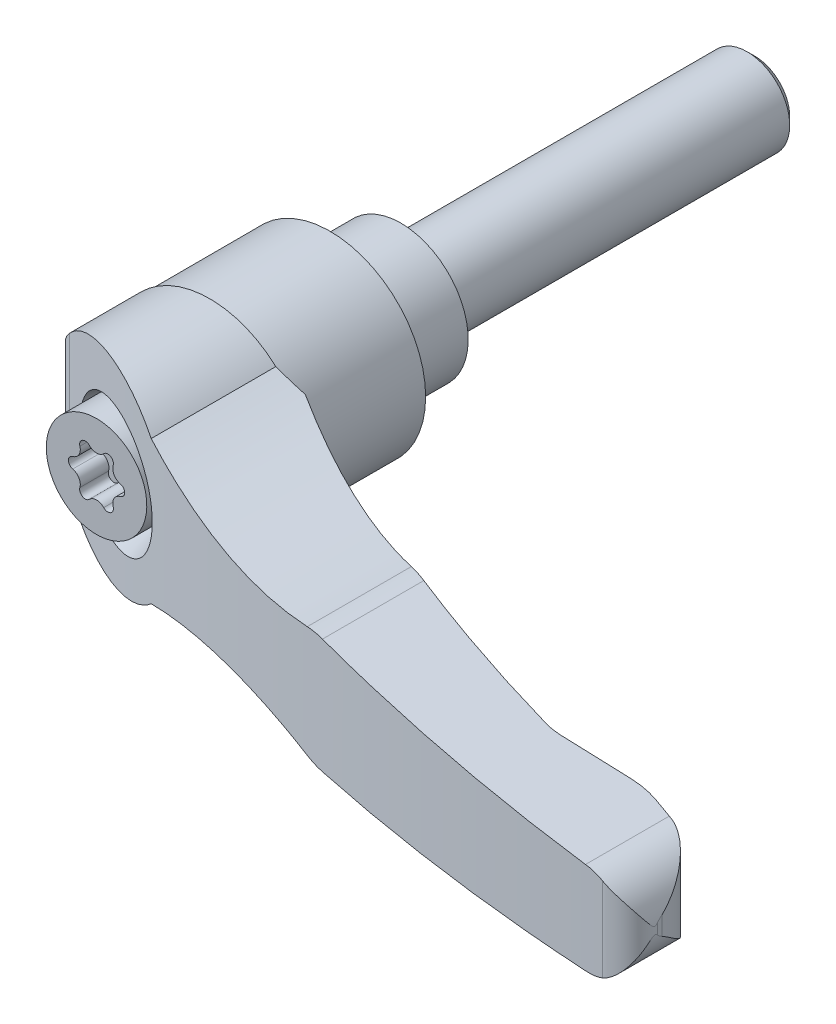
ISO-10303-21;
HEADER;
FILE_DESCRIPTION(('STEP AP214'),'2;1');
FILE_NAME('part.step','',(''),(''),'','','');
FILE_SCHEMA(('AUTOMOTIVE_DESIGN { 1 0 10303 214 1 1 1 1 }'));
ENDSEC;
DATA;
#1=APPLICATION_CONTEXT('core data for automotive mechanical design processes');
#2=APPLICATION_PROTOCOL_DEFINITION('international standard','automotive_design',2000,#1);
#3=PRODUCT_CONTEXT('',#1,'mechanical');
#4=PRODUCT('Part','Part','',(#3));
#5=PRODUCT_RELATED_PRODUCT_CATEGORY('part','',(#4));
#6=PRODUCT_DEFINITION_FORMATION('','',#4);
#7=PRODUCT_DEFINITION_CONTEXT('part definition',#1,'design');
#8=PRODUCT_DEFINITION('design','',#6,#7);
#9=PRODUCT_DEFINITION_SHAPE('','',#8);
#10=(LENGTH_UNIT() NAMED_UNIT(*) SI_UNIT(.MILLI.,.METRE.));
#11=(NAMED_UNIT(*) PLANE_ANGLE_UNIT() SI_UNIT($,.RADIAN.));
#12=(NAMED_UNIT(*) SI_UNIT($,.STERADIAN.) SOLID_ANGLE_UNIT());
#13=UNCERTAINTY_MEASURE_WITH_UNIT(LENGTH_MEASURE(1.E-05),#10,'distance_accuracy_value','');
#14=(GEOMETRIC_REPRESENTATION_CONTEXT(3) GLOBAL_UNCERTAINTY_ASSIGNED_CONTEXT((#13)) GLOBAL_UNIT_ASSIGNED_CONTEXT((#10,
#11,#12)) REPRESENTATION_CONTEXT('',''));
#15=CARTESIAN_POINT('',(0.,0.,0.));
#16=DIRECTION('',(0.,0.,1.));
#17=DIRECTION('',(1.,0.,0.));
#18=AXIS2_PLACEMENT_3D('',#15,#16,#17);
#19=CARTESIAN_POINT('',(0.,0.,-11.962456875));
#20=DIRECTION('',(0.,0.,-1.));
#21=DIRECTION('',(0.,1.,0.));
#22=AXIS2_PLACEMENT_3D('',#19,#20,#21);
#23=CYLINDRICAL_SURFACE('',#22,6.);
#24=CARTESIAN_POINT('',(0.,0.,-48.92));
#25=DIRECTION('',(0.,0.,-1.));
#26=DIRECTION('',(0.,1.,0.));
#27=AXIS2_PLACEMENT_3D('',#24,#25,#26);
#28=CIRCLE('',#27,6.);
#29=CARTESIAN_POINT('',(0.,6.,-48.92));
#30=VERTEX_POINT('',#29);
#31=EDGE_CURVE('E9',#30,#30,#28,.F.);
#32=ORIENTED_EDGE('',*,*,#31,.T.);
#33=EDGE_LOOP('',(#32));
#34=FACE_BOUND('',#33,.T.);
#35=CARTESIAN_POINT('',(0.,0.,0.));
#36=DIRECTION('',(0.,0.,-1.));
#37=DIRECTION('',(0.,1.,0.));
#38=AXIS2_PLACEMENT_3D('',#35,#36,#37);
#39=CIRCLE('',#38,6.);
#40=CARTESIAN_POINT('',(0.,6.,0.));
#41=VERTEX_POINT('',#40);
#42=EDGE_CURVE('E243',#41,#41,#39,.F.);
#43=ORIENTED_EDGE('',*,*,#42,.F.);
#44=EDGE_LOOP('',(#43));
#45=FACE_BOUND('',#44,.T.);
#46=ADVANCED_FACE('F14',(#34,#45),#23,.T.);
#47=CARTESIAN_POINT('',(7.75,0.,0.));
#48=DIRECTION('',(0.,0.,-1.));
#49=DIRECTION('',(0.,1.,0.));
#50=AXIS2_PLACEMENT_3D('',#47,#48,#49);
#51=PLANE('',#50);
#52=ORIENTED_EDGE('',*,*,#42,.T.);
#53=EDGE_LOOP('',(#52));
#54=FACE_BOUND('',#53,.T.);
#55=CARTESIAN_POINT('',(0.,0.,0.));
#56=DIRECTION('',(0.,0.,-1.));
#57=DIRECTION('',(0.,1.,0.));
#58=AXIS2_PLACEMENT_3D('',#55,#56,#57);
#59=CIRCLE('',#58,9.5);
#60=CARTESIAN_POINT('',(0.,9.5,0.));
#61=VERTEX_POINT('',#60);
#62=EDGE_CURVE('E784',#61,#61,#59,.F.);
#63=ORIENTED_EDGE('',*,*,#62,.F.);
#64=EDGE_LOOP('',(#63));
#65=FACE_BOUND('',#64,.T.);
#66=ADVANCED_FACE('F822',(#54,#65),#51,.T.);
#67=CARTESIAN_POINT('',(0.,0.,12.4));
#68=DIRECTION('',(0.,0.,-1.));
#69=DIRECTION('',(0.,1.,0.));
#70=AXIS2_PLACEMENT_3D('',#67,#68,#69);
#71=CYLINDRICAL_SURFACE('',#70,9.5);
#72=ORIENTED_EDGE('',*,*,#62,.T.);
#73=EDGE_LOOP('',(#72));
#74=FACE_BOUND('',#73,.T.);
#75=CARTESIAN_POINT('',(0.,0.,10.7));
#76=DIRECTION('',(0.,0.,-1.));
#77=DIRECTION('',(1.,0.,0.));
#78=AXIS2_PLACEMENT_3D('',#75,#76,#77);
#79=CIRCLE('',#78,9.5);
#80=CARTESIAN_POINT('',(9.5,0.,10.7));
#81=VERTEX_POINT('',#80);
#82=EDGE_CURVE('E326',#81,#81,#79,.T.);
#83=ORIENTED_EDGE('',*,*,#82,.T.);
#84=EDGE_LOOP('',(#83));
#85=FACE_BOUND('',#84,.T.);
#86=ADVANCED_FACE('F584',(#74,#85),#71,.T.);
#87=CARTESIAN_POINT('',(0.,0.,10.4));
#88=DIRECTION('',(0.,0.,-1.));
#89=DIRECTION('',(0.,1.,0.));
#90=AXIS2_PLACEMENT_3D('',#87,#88,#89);
#91=CONICAL_SURFACE('',#90,9.8,0.785398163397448);
#92=ORIENTED_EDGE('',*,*,#82,.F.);
#93=EDGE_LOOP('',(#92));
#94=FACE_BOUND('',#93,.T.);
#95=CARTESIAN_POINT('',(0.,0.,10.4));
#96=DIRECTION('',(0.,0.,-1.));
#97=DIRECTION('',(0.,1.,0.));
#98=AXIS2_PLACEMENT_3D('',#95,#96,#97);
#99=CIRCLE('',#98,9.8);
#100=CARTESIAN_POINT('',(0.,9.8,10.4));
#101=VERTEX_POINT('',#100);
#102=EDGE_CURVE('E322',#101,#101,#99,.T.);
#103=ORIENTED_EDGE('',*,*,#102,.T.);
#104=EDGE_LOOP('',(#103));
#105=FACE_BOUND('',#104,.T.);
#106=ADVANCED_FACE('F585',(#94,#105),#91,.F.);
#107=CARTESIAN_POINT('',(0.,0.,9.7));
#108=DIRECTION('',(0.,0.,-1.));
#109=DIRECTION('',(0.,1.,0.));
#110=AXIS2_PLACEMENT_3D('',#107,#108,#109);
#111=CYLINDRICAL_SURFACE('',#110,9.8);
#112=ORIENTED_EDGE('',*,*,#102,.F.);
#113=EDGE_LOOP('',(#112));
#114=FACE_BOUND('',#113,.T.);
#115=CARTESIAN_POINT('',(0.,0.,10.));
#116=DIRECTION('',(0.,0.,-1.));
#117=DIRECTION('',(0.,1.,0.));
#118=AXIS2_PLACEMENT_3D('',#115,#116,#117);
#119=CIRCLE('',#118,9.8);
#120=CARTESIAN_POINT('',(0.,9.8,10.));
#121=VERTEX_POINT('',#120);
#122=EDGE_CURVE('E325',#121,#121,#119,.F.);
#123=ORIENTED_EDGE('',*,*,#122,.F.);
#124=EDGE_LOOP('',(#123));
#125=FACE_BOUND('',#124,.T.);
#126=ADVANCED_FACE('F588',(#114,#125),#111,.F.);
#127=CARTESIAN_POINT('',(-13.2600377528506,-27.5,10.));
#128=DIRECTION('',(0.707106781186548,0.,0.707106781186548));
#129=DIRECTION('',(-0.707106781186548,0.,0.707106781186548));
#130=AXIS2_PLACEMENT_3D('',#127,#128,#129);
#131=PLANE('',#130);
#132=DIRECTION('',(0.,1.,0.));
#133=VECTOR('',#132,1.);
#134=CARTESIAN_POINT('',(-13.2600377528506,0.,10.));
#135=LINE('',#134,#133);
#136=CARTESIAN_POINT('',(-13.2600377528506,-2.58582666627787,10.));
#137=VERTEX_POINT('',#136);
#138=CARTESIAN_POINT('',(-13.2600377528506,2.58582666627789,10.));
#139=VERTEX_POINT('',#138);
#140=EDGE_CURVE('E770',#137,#139,#135,.T.);
#141=ORIENTED_EDGE('',*,*,#140,.F.);
#142=CARTESIAN_POINT('',(-0.00999999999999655,0.,-3.25003775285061));
#143=DIRECTION('',(0.707106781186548,0.,0.707106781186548));
#144=DIRECTION('',(-0.707106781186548,0.,0.707106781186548));
#145=AXIS2_PLACEMENT_3D('',#142,#143,#144);
#146=ELLIPSE('',#145,19.0918830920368,13.5);
#147=EDGE_CURVE('E772',#139,#137,#146,.T.);
#148=ORIENTED_EDGE('',*,*,#147,.F.);
#149=EDGE_LOOP('',(#141,#148));
#150=FACE_BOUND('',#149,.T.);
#151=ADVANCED_FACE('F592',(#150),#131,.F.);
#152=CARTESIAN_POINT('',(-6.76,0.,10.));
#153=DIRECTION('',(0.,0.,-1.));
#154=DIRECTION('',(0.,1.,0.));
#155=AXIS2_PLACEMENT_3D('',#152,#153,#154);
#156=PLANE('',#155);
#157=ORIENTED_EDGE('',*,*,#140,.T.);
#158=CARTESIAN_POINT('',(-0.00999999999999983,0.,10.));
#159=DIRECTION('',(0.,0.,1.));
#160=DIRECTION('',(-1.,0.,0.));
#161=AXIS2_PLACEMENT_3D('',#158,#159,#160);
#162=CIRCLE('',#161,13.5);
#163=EDGE_CURVE('E775',#137,#139,#162,.T.);
#164=ORIENTED_EDGE('',*,*,#163,.F.);
#165=EDGE_LOOP('',(#157,#164));
#166=FACE_BOUND('',#165,.T.);
#167=ORIENTED_EDGE('',*,*,#122,.T.);
#168=EDGE_LOOP('',(#167));
#169=FACE_BOUND('',#168,.T.);
#170=ADVANCED_FACE('F596',(#166,#169),#156,.T.);
#171=CARTESIAN_POINT('',(-0.0100000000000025,0.,20.75));
#172=DIRECTION('',(0.,0.,1.));
#173=DIRECTION('',(-1.,0.,0.));
#174=AXIS2_PLACEMENT_3D('',#171,#172,#173);
#175=CYLINDRICAL_SURFACE('',#174,13.5);
#176=ORIENTED_EDGE('',*,*,#163,.T.);
#177=ORIENTED_EDGE('',*,*,#147,.T.);
#178=EDGE_LOOP('',(#176,#177));
#179=FACE_BOUND('',#178,.T.);
#180=CARTESIAN_POINT('',(-0.010000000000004,0.,27.));
#181=DIRECTION('',(0.,0.,1.));
#182=DIRECTION('',(-1.,0.,0.));
#183=AXIS2_PLACEMENT_3D('',#180,#181,#182);
#184=CIRCLE('',#183,13.5);
#185=CARTESIAN_POINT('',(-13.51,0.,27.));
#186=VERTEX_POINT('',#185);
#187=CARTESIAN_POINT('',(13.4899999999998,0.,27.));
#188=VERTEX_POINT('',#187);
#189=EDGE_CURVE('E311',#186,#188,#184,.T.);
#190=ORIENTED_EDGE('',*,*,#189,.F.);
#191=CARTESIAN_POINT('',(-0.010000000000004,0.,27.));
#192=DIRECTION('',(0.,0.,1.));
#193=DIRECTION('',(-1.,0.,0.));
#194=AXIS2_PLACEMENT_3D('',#191,#192,#193);
#195=CIRCLE('',#194,13.5);
#196=EDGE_CURVE('E316',#188,#186,#195,.T.);
#197=ORIENTED_EDGE('',*,*,#196,.F.);
#198=EDGE_LOOP('',(#190,#197));
#199=FACE_BOUND('',#198,.T.);
#200=ADVANCED_FACE('F600',(#179,#199),#175,.T.);
#201=CARTESIAN_POINT('',(94.8688366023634,-14.75,58.0130023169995));
#202=DIRECTION('',(0.992331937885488,0.,-0.123601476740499));
#203=DIRECTION('',(0.123601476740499,0.,0.992331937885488));
#204=AXIS2_PLACEMENT_3D('',#201,#202,#203);
#205=PLANE('',#204);
#206=CARTESIAN_POINT('',(88.5,0.,6.88092740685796));
#207=DIRECTION('',(0.992331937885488,0.,-0.123601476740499));
#208=DIRECTION('',(0.123601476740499,0.,0.992331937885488));
#209=AXIS2_PLACEMENT_3D('',#206,#207,#208);
#210=ELLIPSE('',#209,52.588368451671,6.5);
#211=CARTESIAN_POINT('',(94.9511621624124,-0.795302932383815,58.6739513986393));
#212=VERTEX_POINT('',#211);
#213=CARTESIAN_POINT('',(94.8688366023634,-1.29919988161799,58.0130023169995));
#214=VERTEX_POINT('',#213);
#215=EDGE_CURVE('E768',#212,#214,#210,.T.);
#216=ORIENTED_EDGE('',*,*,#215,.T.);
#217=DIRECTION('',(0.,-1.,0.));
#218=VECTOR('',#217,1.);
#219=CARTESIAN_POINT('',(94.8688366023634,-14.75,58.0130023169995));
#220=LINE('',#219,#218);
#221=CARTESIAN_POINT('',(94.8688366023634,1.29919988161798,58.0130023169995));
#222=VERTEX_POINT('',#221);
#223=EDGE_CURVE('E303',#222,#214,#220,.T.);
#224=ORIENTED_EDGE('',*,*,#223,.F.);
#225=CARTESIAN_POINT('',(88.5,0.,6.88092740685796));
#226=DIRECTION('',(0.992331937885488,0.,-0.123601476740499));
#227=DIRECTION('',(0.123601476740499,0.,0.992331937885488));
#228=AXIS2_PLACEMENT_3D('',#225,#226,#227);
#229=ELLIPSE('',#228,52.588368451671,6.5);
#230=CARTESIAN_POINT('',(94.9511621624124,0.795302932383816,58.6739513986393));
#231=VERTEX_POINT('',#230);
#232=EDGE_CURVE('E769',#222,#231,#229,.T.);
#233=ORIENTED_EDGE('',*,*,#232,.T.);
#234=DIRECTION('',(0.,-1.,0.));
#235=VECTOR('',#234,1.);
#236=CARTESIAN_POINT('',(94.9511621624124,-14.75,58.6739513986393));
#237=LINE('',#236,#235);
#238=EDGE_CURVE('E765',#231,#212,#237,.T.);
#239=ORIENTED_EDGE('',*,*,#238,.T.);
#240=EDGE_LOOP('',(#216,#224,#233,#239));
#241=FACE_BOUND('',#240,.T.);
#242=ADVANCED_FACE('F604',(#241),#205,.T.);
#243=CARTESIAN_POINT('',(-13.51,-14.75,27.));
#244=DIRECTION('',(0.,0.,-1.));
#245=DIRECTION('',(0.,1.,0.));
#246=AXIS2_PLACEMENT_3D('',#243,#244,#245);
#247=PLANE('',#246);
#248=DIRECTION('',(0.,-1.,0.));
#249=VECTOR('',#248,1.);
#250=CARTESIAN_POINT('',(-13.51,-14.75,27.));
#251=LINE('',#250,#249);
#252=CARTESIAN_POINT('',(-13.51,2.55781156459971,27.));
#253=VERTEX_POINT('',#252);
#254=EDGE_CURVE('E312',#253,#186,#251,.T.);
#255=ORIENTED_EDGE('',*,*,#254,.F.);
#256=CARTESIAN_POINT('',(0.,0.,27.));
#257=DIRECTION('',(0.,0.,1.));
#258=DIRECTION('',(0.,-1.,0.));
#259=AXIS2_PLACEMENT_3D('',#256,#257,#258);
#260=CIRCLE('',#259,13.75);
#261=CARTESIAN_POINT('',(9.32365402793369,10.1060365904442,27.));
#262=VERTEX_POINT('',#261);
#263=EDGE_CURVE('E488',#262,#253,#260,.T.);
#264=ORIENTED_EDGE('',*,*,#263,.F.);
#265=CARTESIAN_POINT('',(29.15,64.91,27.));
#266=DIRECTION('',(0.,0.,1.));
#267=DIRECTION('',(0.,-1.,0.));
#268=AXIS2_PLACEMENT_3D('',#265,#266,#267);
#269=CIRCLE('',#268,58.28);
#270=CARTESIAN_POINT('',(13.4899999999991,8.77335599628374,27.));
#271=VERTEX_POINT('',#270);
#272=EDGE_CURVE('E450',#262,#271,#269,.T.);
#273=ORIENTED_EDGE('',*,*,#272,.T.);
#274=DIRECTION('',(0.,-1.,0.));
#275=VECTOR('',#274,1.);
#276=CARTESIAN_POINT('',(13.4899999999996,-14.75,27.0000000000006));
#277=LINE('',#276,#275);
#278=EDGE_CURVE('E307',#271,#188,#277,.T.);
#279=ORIENTED_EDGE('',*,*,#278,.T.);
#280=ORIENTED_EDGE('',*,*,#196,.T.);
#281=EDGE_LOOP('',(#255,#264,#273,#279,#280));
#282=FACE_BOUND('',#281,.T.);
#283=ADVANCED_FACE('F608',(#282),#247,.T.);
#284=CARTESIAN_POINT('',(-13.51,-14.75,31.4135672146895));
#285=DIRECTION('',(-1.,0.,0.));
#286=DIRECTION('',(0.,-1.,0.));
#287=AXIS2_PLACEMENT_3D('',#284,#285,#286);
#288=PLANE('',#287);
#289=DIRECTION('',(0.,0.,1.));
#290=VECTOR('',#289,1.);
#291=CARTESIAN_POINT('',(-13.51,-2.5578115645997,63.));
#292=LINE('',#291,#290);
#293=CARTESIAN_POINT('',(-13.51,-2.55781156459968,31.4135672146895));
#294=VERTEX_POINT('',#293);
#295=CARTESIAN_POINT('',(-13.51,-2.55781156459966,27.));
#296=VERTEX_POINT('',#295);
#297=EDGE_CURVE('E315',#294,#296,#292,.F.);
#298=ORIENTED_EDGE('',*,*,#297,.F.);
#299=DIRECTION('',(0.,-1.,0.));
#300=VECTOR('',#299,1.);
#301=CARTESIAN_POINT('',(-13.51,-14.75,31.4135672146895));
#302=LINE('',#301,#300);
#303=CARTESIAN_POINT('',(-13.51,2.55781156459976,31.4135672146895));
#304=VERTEX_POINT('',#303);
#305=EDGE_CURVE('E502',#304,#294,#302,.T.);
#306=ORIENTED_EDGE('',*,*,#305,.F.);
#307=DIRECTION('',(0.,0.,1.));
#308=VECTOR('',#307,1.);
#309=CARTESIAN_POINT('',(-13.51,2.55781156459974,63.));
#310=LINE('',#309,#308);
#311=EDGE_CURVE('E491',#253,#304,#310,.T.);
#312=ORIENTED_EDGE('',*,*,#311,.F.);
#313=ORIENTED_EDGE('',*,*,#254,.T.);
#314=DIRECTION('',(0.,1.,0.));
#315=VECTOR('',#314,1.);
#316=CARTESIAN_POINT('',(-13.51,-14.75,27.));
#317=LINE('',#316,#315);
#318=EDGE_CURVE('E750',#296,#186,#317,.T.);
#319=ORIENTED_EDGE('',*,*,#318,.F.);
#320=EDGE_LOOP('',(#298,#306,#312,#313,#319));
#321=FACE_BOUND('',#320,.T.);
#322=ADVANCED_FACE('F612',(#321),#288,.T.);
#323=CARTESIAN_POINT('',(-13.51,-14.75,27.));
#324=DIRECTION('',(0.,0.,-1.));
#325=DIRECTION('',(0.,1.,0.));
#326=AXIS2_PLACEMENT_3D('',#323,#324,#325);
#327=PLANE('',#326);
#328=ORIENTED_EDGE('',*,*,#189,.T.);
#329=DIRECTION('',(0.,-1.,0.));
#330=VECTOR('',#329,1.);
#331=CARTESIAN_POINT('',(13.4899999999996,-14.75,27.0000000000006));
#332=LINE('',#331,#330);
#333=CARTESIAN_POINT('',(13.4899999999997,-8.77335599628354,27.));
#334=VERTEX_POINT('',#333);
#335=EDGE_CURVE('E741',#188,#334,#332,.T.);
#336=ORIENTED_EDGE('',*,*,#335,.T.);
#337=CARTESIAN_POINT('',(29.15,-64.91,27.));
#338=DIRECTION('',(0.,0.,1.));
#339=DIRECTION('',(0.,-1.,0.));
#340=AXIS2_PLACEMENT_3D('',#337,#338,#339);
#341=CIRCLE('',#340,58.28);
#342=CARTESIAN_POINT('',(9.32365402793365,-10.1060365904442,27.));
#343=VERTEX_POINT('',#342);
#344=EDGE_CURVE('E737',#334,#343,#341,.T.);
#345=ORIENTED_EDGE('',*,*,#344,.T.);
#346=CARTESIAN_POINT('',(0.,0.,27.));
#347=DIRECTION('',(0.,0.,1.));
#348=DIRECTION('',(0.,-1.,0.));
#349=AXIS2_PLACEMENT_3D('',#346,#347,#348);
#350=CIRCLE('',#349,13.75);
#351=EDGE_CURVE('E736',#296,#343,#350,.T.);
#352=ORIENTED_EDGE('',*,*,#351,.F.);
#353=ORIENTED_EDGE('',*,*,#318,.T.);
#354=EDGE_LOOP('',(#328,#336,#345,#352,#353));
#355=FACE_BOUND('',#354,.T.);
#356=ADVANCED_FACE('F616',(#355),#327,.T.);
#357=CARTESIAN_POINT('',(81.4673032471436,-14.75,62.36));
#358=DIRECTION('',(0.,-1.,0.));
#359=DIRECTION('',(1.,0.,0.));
#360=AXIS2_PLACEMENT_3D('',#357,#358,#359);
#361=CYLINDRICAL_SURFACE('',#360,13.39);
#362=CARTESIAN_POINT('',(81.4673032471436,-6.75541913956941,62.36));
#363=DIRECTION('',(-0.0362948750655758,0.999341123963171,0.));
#364=DIRECTION('',(-0.999341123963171,-0.0362948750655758,0.));
#365=AXIS2_PLACEMENT_3D('',#362,#363,#364);
#366=ELLIPSE('',#365,13.3988281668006,13.39);
#367=CARTESIAN_POINT('',(85.7182287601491,-6.60103060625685,49.6626879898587));
#368=VERTEX_POINT('',#367);
#369=CARTESIAN_POINT('',(81.4673032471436,-6.75541913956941,48.97));
#370=VERTEX_POINT('',#369);
#371=EDGE_CURVE('E640',#368,#370,#366,.T.);
#372=ORIENTED_EDGE('',*,*,#371,.T.);
#373=DIRECTION('',(0.,1.,0.));
#374=VECTOR('',#373,1.);
#375=CARTESIAN_POINT('',(81.4673032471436,-14.75,48.97));
#376=LINE('',#375,#374);
#377=CARTESIAN_POINT('',(81.4673032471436,6.75541913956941,48.97));
#378=VERTEX_POINT('',#377);
#379=EDGE_CURVE('E308',#378,#370,#376,.F.);
#380=ORIENTED_EDGE('',*,*,#379,.F.);
#381=CARTESIAN_POINT('',(81.4673032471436,6.75541913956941,62.36));
#382=DIRECTION('',(-0.0362948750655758,-0.999341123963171,0.));
#383=DIRECTION('',(0.999341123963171,-0.0362948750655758,0.));
#384=AXIS2_PLACEMENT_3D('',#381,#382,#383);
#385=ELLIPSE('',#384,13.3988281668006,13.39);
#386=CARTESIAN_POINT('',(85.7182287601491,6.60103060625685,49.6626879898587));
#387=VERTEX_POINT('',#386);
#388=EDGE_CURVE('E452',#378,#387,#385,.T.);
#389=ORIENTED_EDGE('',*,*,#388,.T.);
#390=DIRECTION('',(0.,-1.,0.));
#391=VECTOR('',#390,1.);
#392=CARTESIAN_POINT('',(85.7182287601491,-14.75,49.6626879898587));
#393=LINE('',#392,#391);
#394=EDGE_CURVE('E300',#368,#387,#393,.F.);
#395=ORIENTED_EDGE('',*,*,#394,.F.);
#396=EDGE_LOOP('',(#372,#380,#389,#395));
#397=FACE_BOUND('',#396,.T.);
#398=ADVANCED_FACE('F620',(#397),#361,.T.);
#399=CARTESIAN_POINT('',(71.6523269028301,-14.75,48.97));
#400=DIRECTION('',(0.,0.,-1.));
#401=DIRECTION('',(0.,1.,0.));
#402=AXIS2_PLACEMENT_3D('',#399,#400,#401);
#403=PLANE('',#402);
#404=DIRECTION('',(-0.999341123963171,-0.0362948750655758,0.));
#405=VECTOR('',#404,1.);
#406=CARTESIAN_POINT('',(88.5,-6.5,48.97));
#407=LINE('',#406,#405);
#408=CARTESIAN_POINT('',(71.6523269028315,-7.11188734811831,48.97));
#409=VERTEX_POINT('',#408);
#410=EDGE_CURVE('E632',#370,#409,#407,.T.);
#411=ORIENTED_EDGE('',*,*,#410,.T.);
#412=DIRECTION('',(0.,-1.,0.));
#413=VECTOR('',#412,1.);
#414=CARTESIAN_POINT('',(71.6523269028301,-14.75,48.97));
#415=LINE('',#414,#413);
#416=CARTESIAN_POINT('',(71.6523269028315,7.11188734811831,48.97));
#417=VERTEX_POINT('',#416);
#418=EDGE_CURVE('E305',#409,#417,#415,.F.);
#419=ORIENTED_EDGE('',*,*,#418,.T.);
#420=DIRECTION('',(0.999341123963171,-0.0362948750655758,0.));
#421=VECTOR('',#420,1.);
#422=CARTESIAN_POINT('',(43.9670619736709,8.1173830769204,48.97));
#423=LINE('',#422,#421);
#424=EDGE_CURVE('E760',#417,#378,#423,.T.);
#425=ORIENTED_EDGE('',*,*,#424,.T.);
#426=ORIENTED_EDGE('',*,*,#379,.T.);
#427=EDGE_LOOP('',(#411,#419,#425,#426));
#428=FACE_BOUND('',#427,.T.);
#429=ADVANCED_FACE('F623',(#428),#403,.T.);
#430=CARTESIAN_POINT('',(71.6523269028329,-14.75,38.8899999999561));
#431=DIRECTION('',(0.,-1.,0.));
#432=DIRECTION('',(1.,0.,0.));
#433=AXIS2_PLACEMENT_3D('',#430,#431,#432);
#434=CYLINDRICAL_SURFACE('',#433,10.0800000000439);
#435=ORIENTED_EDGE('',*,*,#418,.F.);
#436=CARTESIAN_POINT('',(71.6523269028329,-7.11188734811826,38.8899999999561));
#437=DIRECTION('',(-0.0362948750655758,0.999341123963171,0.));
#438=DIRECTION('',(-0.999341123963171,-0.0362948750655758,0.));
#439=AXIS2_PLACEMENT_3D('',#436,#437,#438);
#440=ELLIPSE('',#439,10.086645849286,10.0800000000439);
#441=CARTESIAN_POINT('',(69.1344137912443,-7.20333494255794,48.6504566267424));
#442=VERTEX_POINT('',#441);
#443=EDGE_CURVE('E639',#409,#442,#440,.F.);
#444=ORIENTED_EDGE('',*,*,#443,.T.);
#445=DIRECTION('',(0.,-1.,0.));
#446=VECTOR('',#445,1.);
#447=CARTESIAN_POINT('',(69.1344156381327,-14.75,48.6504571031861));
#448=LINE('',#447,#446);
#449=CARTESIAN_POINT('',(69.1344137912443,7.20333494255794,48.6504566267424));
#450=VERTEX_POINT('',#449);
#451=EDGE_CURVE('E744',#442,#450,#448,.F.);
#452=ORIENTED_EDGE('',*,*,#451,.T.);
#453=CARTESIAN_POINT('',(71.6523269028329,7.11188734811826,38.8899999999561));
#454=DIRECTION('',(-0.0362948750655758,-0.999341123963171,0.));
#455=DIRECTION('',(0.999341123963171,-0.0362948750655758,0.));
#456=AXIS2_PLACEMENT_3D('',#453,#454,#455);
#457=ELLIPSE('',#456,10.086645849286,10.0800000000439);
#458=EDGE_CURVE('E643',#450,#417,#457,.F.);
#459=ORIENTED_EDGE('',*,*,#458,.T.);
#460=EDGE_LOOP('',(#435,#444,#452,#459));
#461=FACE_BOUND('',#460,.T.);
#462=ADVANCED_FACE('F460',(#461),#434,.F.);
#463=CARTESIAN_POINT('',(132.162219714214,-14.75,-195.670803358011));
#464=DIRECTION('',(0.,-1.,0.));
#465=DIRECTION('',(1.,0.,0.));
#466=AXIS2_PLACEMENT_3D('',#463,#464,#465);
#467=CYLINDRICAL_SURFACE('',#466,252.32);
#468=CARTESIAN_POINT('',(43.9670619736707,8.11738307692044,40.7335040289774));
#469=CARTESIAN_POINT('',(43.7285909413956,8.12604852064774,40.6445396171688));
#470=CARTESIAN_POINT('',(43.4900264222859,8.12742192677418,40.5551257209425));
#471=CARTESIAN_POINT('',(43.014251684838,8.11567103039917,40.375985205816));
#472=CARTESIAN_POINT('',(42.7770395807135,8.10259351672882,40.2862605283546));
#473=CARTESIAN_POINT('',(42.3039618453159,8.06208212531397,40.1065066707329));
#474=CARTESIAN_POINT('',(42.0680962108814,8.03464828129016,40.0164774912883));
#475=CARTESIAN_POINT('',(41.5977019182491,7.96541677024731,39.8361272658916));
#476=CARTESIAN_POINT('',(41.3631800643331,7.92357286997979,39.7458062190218));
#477=CARTESIAN_POINT('',(41.1300932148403,7.87460952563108,39.6556387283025));
#478=B_SPLINE_CURVE_WITH_KNOTS('',3,(#468,#469,#470,#471,#472,#473,#474,#475,#476,#477),
.UNSPECIFIED.,.F.,.F.,(4,2,2,2,4),(0.,0.763908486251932,1.52535083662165,2.28679139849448,
3.05069808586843),.UNSPECIFIED.);
#479=CARTESIAN_POINT('',(43.9670619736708,8.11738307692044,40.7335040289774));
#480=VERTEX_POINT('',#479);
#481=CARTESIAN_POINT('',(41.1300932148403,7.87460952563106,39.6556387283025));
#482=VERTEX_POINT('',#481);
#483=EDGE_CURVE('E440',#480,#482,#478,.T.);
#484=ORIENTED_EDGE('',*,*,#483,.F.);
#485=CARTESIAN_POINT('',(132.162219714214,4.9142403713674,-195.670803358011));
#486=DIRECTION('',(-0.0362948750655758,-0.999341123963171,0.));
#487=DIRECTION('',(0.999341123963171,-0.0362948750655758,0.));
#488=AXIS2_PLACEMENT_3D('',#485,#486,#487);
#489=ELLIPSE('',#488,252.486357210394,252.32);
#490=EDGE_CURVE('E715',#480,#450,#489,.F.);
#491=ORIENTED_EDGE('',*,*,#490,.T.);
#492=ORIENTED_EDGE('',*,*,#451,.F.);
#493=CARTESIAN_POINT('',(132.162219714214,-4.91424037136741,-195.670803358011));
#494=DIRECTION('',(-0.0362948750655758,0.999341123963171,0.));
#495=DIRECTION('',(-0.999341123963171,-0.0362948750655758,0.));
#496=AXIS2_PLACEMENT_3D('',#493,#494,#495);
#497=ELLIPSE('',#496,252.486357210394,252.32);
#498=CARTESIAN_POINT('',(43.9670619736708,-8.11738307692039,40.7335040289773));
#499=VERTEX_POINT('',#498);
#500=EDGE_CURVE('E647',#442,#499,#497,.F.);
#501=ORIENTED_EDGE('',*,*,#500,.T.);
#502=CARTESIAN_POINT('',(41.1300929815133,-7.87460947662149,39.6556386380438));
#503=CARTESIAN_POINT('',(41.3631798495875,-7.92357282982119,39.7458061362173));
#504=CARTESIAN_POINT('',(41.5977017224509,-7.96541673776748,39.8361271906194));
#505=CARTESIAN_POINT('',(42.0680960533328,-8.03464826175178,40.0164774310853));
#506=CARTESIAN_POINT('',(42.3039617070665,-8.06208211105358,40.1065066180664));
#507=CARTESIAN_POINT('',(42.7770394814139,-8.10259351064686,40.2862604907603));
#508=CARTESIAN_POINT('',(43.0142516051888,-8.11567102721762,40.3759851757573));
#509=CARTESIAN_POINT('',(43.4900263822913,-8.12742192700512,40.5551257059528));
#510=CARTESIAN_POINT('',(43.7285909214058,-8.12604852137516,40.6445396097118));
#511=CARTESIAN_POINT('',(43.9670619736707,-8.11738307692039,40.7335040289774));
#512=B_SPLINE_CURVE_WITH_KNOTS('',3,(#502,#503,#504,#505,#506,#507,#508,#509,#510,#511),
.UNSPECIFIED.,.F.,.F.,(4,2,2,2,4),(0.,0.763906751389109,1.52534737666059,2.28678979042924,
3.05069834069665),.UNSPECIFIED.);
#513=CARTESIAN_POINT('',(41.1300929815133,-7.8746094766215,39.6556386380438));
#514=VERTEX_POINT('',#513);
#515=EDGE_CURVE('E475',#514,#499,#512,.T.);
#516=ORIENTED_EDGE('',*,*,#515,.F.);
#517=CARTESIAN_POINT('',(41.1300929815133,-7.87460947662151,39.6556386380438));
#518=CARTESIAN_POINT('',(40.2468666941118,-7.68907790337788,39.3139933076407));
#519=CARTESIAN_POINT('',(39.3617638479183,-7.52459842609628,38.9658739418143));
#520=CARTESIAN_POINT('',(37.5897998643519,-7.23736069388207,38.2572801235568));
#521=CARTESIAN_POINT('',(36.7029388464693,-7.11459969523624,37.8968064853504));
#522=CARTESIAN_POINT('',(34.9294341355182,-6.91040287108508,37.1640922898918));
#523=CARTESIAN_POINT('',(34.0427904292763,-6.8289625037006,36.7918530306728));
#524=CARTESIAN_POINT('',(32.2715033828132,-6.70688253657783,36.0362417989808));
#525=CARTESIAN_POINT('',(31.3868600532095,-6.66624315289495,35.652869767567));
#526=CARTESIAN_POINT('',(28.7704435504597,-6.60545291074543,34.5011035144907));
#527=CARTESIAN_POINT('',(27.0436661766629,-6.64276527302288,33.7176215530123));
#528=CARTESIAN_POINT('',(23.6170342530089,-6.86784257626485,32.1161606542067));
#529=CARTESIAN_POINT('',(21.9171693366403,-7.05554807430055,31.2981954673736));
#530=CARTESIAN_POINT('',(19.6661800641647,-7.4039275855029,30.1840812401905));
#531=CARTESIAN_POINT('',(19.0983988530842,-7.50046620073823,29.9003744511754));
#532=CARTESIAN_POINT('',(17.9675115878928,-7.70999213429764,29.3299782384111));
#533=CARTESIAN_POINT('',(17.4044045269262,-7.82297580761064,29.043289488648));
#534=CARTESIAN_POINT('',(16.2796310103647,-8.06595772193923,28.4653390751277));
#535=CARTESIAN_POINT('',(15.7179955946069,-8.19605796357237,28.1740600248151));
#536=CARTESIAN_POINT('',(14.5999573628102,-8.472545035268,27.5889003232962));
#537=CARTESIAN_POINT('',(14.0435556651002,-8.61893526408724,27.2950191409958));
#538=CARTESIAN_POINT('',(13.4899999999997,-8.77335599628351,27.0000000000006));
#539=B_SPLINE_CURVE_WITH_KNOTS('',3,(#517,#518,#519,#520,#521,#522,#523,#524,#525,#526,#527,
#528,#529,#530,#531,#532,#533,#534,#535,#536,#537,#538),.UNSPECIFIED.,.F.,.F.,(4,2,2,2,2,2,2,2,
2,2,4),(0.,2.89469970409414,5.78920899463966,8.6834000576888,11.5776064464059,17.2602540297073,
22.940656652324,24.866551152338,26.7920194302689,28.7295308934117,30.6674473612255),.UNSPECIFIED.);
#540=EDGE_CURVE('E466',#514,#334,#539,.T.);
#541=ORIENTED_EDGE('',*,*,#540,.T.);
#542=ORIENTED_EDGE('',*,*,#335,.F.);
#543=ORIENTED_EDGE('',*,*,#278,.F.);
#544=CARTESIAN_POINT('',(13.4899999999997,8.77335599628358,27.0000000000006));
#545=CARTESIAN_POINT('',(14.31664655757,8.54275177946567,27.4405727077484));
#546=CARTESIAN_POINT('',(15.149663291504,8.33005321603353,27.8786057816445));
#547=CARTESIAN_POINT('',(16.82730612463,7.94113938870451,28.7487404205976));
#548=CARTESIAN_POINT('',(17.6719330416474,7.76492670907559,29.1808415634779));
#549=CARTESIAN_POINT('',(19.3724293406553,7.44952599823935,30.0386421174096));
#550=CARTESIAN_POINT('',(20.2283094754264,7.31037656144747,30.4643344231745));
#551=CARTESIAN_POINT('',(21.9491324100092,7.07004305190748,31.3079971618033));
#552=CARTESIAN_POINT('',(22.8140749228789,6.96885778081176,31.725967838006));
#553=CARTESIAN_POINT('',(24.5350860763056,6.80669813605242,32.5454832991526));
#554=CARTESIAN_POINT('',(25.3910090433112,6.74499321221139,32.9471893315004));
#555=CARTESIAN_POINT('',(27.1088771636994,6.65940525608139,33.7416486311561));
#556=CARTESIAN_POINT('',(27.9708222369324,6.63552172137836,34.1344020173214));
#557=CARTESIAN_POINT('',(29.6986634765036,6.62618362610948,34.9099811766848));
#558=CARTESIAN_POINT('',(30.5645565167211,6.64070263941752,35.2928135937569));
#559=CARTESIAN_POINT('',(32.2992228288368,6.70867652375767,36.0481188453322));
#560=CARTESIAN_POINT('',(33.1679956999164,6.76212618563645,36.4205930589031));
#561=CARTESIAN_POINT('',(34.6268488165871,6.88489763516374,37.0364018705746));
#562=CARTESIAN_POINT('',(35.2165959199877,6.94356774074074,37.2827020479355));
#563=CARTESIAN_POINT('',(36.396064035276,7.07916681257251,37.7700518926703));
#564=CARTESIAN_POINT('',(36.9857850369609,7.15609293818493,38.0111023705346));
#565=CARTESIAN_POINT('',(38.1685846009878,7.32890006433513,38.4893735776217));
#566=CARTESIAN_POINT('',(38.7616598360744,7.42490199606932,38.7265588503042));
#567=CARTESIAN_POINT('',(39.9468049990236,7.63566195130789,39.1953420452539));
#568=CARTESIAN_POINT('',(40.5388747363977,7.75042319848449,39.4269389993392));
#569=CARTESIAN_POINT('',(41.1300932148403,7.87460952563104,39.6556387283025));
#570=B_SPLINE_CURVE_WITH_KNOTS('',3,(#544,#545,#546,#547,#548,#549,#550,#551,#552,#553,#554,
#555,#556,#557,#558,#559,#560,#561,#562,#563,#564,#565,#566,#567,#568,#569),.UNSPECIFIED.,.F.,
.F.,(4,2,2,2,2,2,2,2,2,2,2,2,4),(0.,2.89390785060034,5.78802060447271,8.68513535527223,
11.5821586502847,14.4238937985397,17.2655911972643,20.1053336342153,22.9446961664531,
24.8698413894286,26.7946872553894,28.7321491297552,30.6699442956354),.UNSPECIFIED.);
#571=EDGE_CURVE('E481',#271,#482,#570,.T.);
#572=ORIENTED_EDGE('',*,*,#571,.T.);
#573=EDGE_LOOP('',(#484,#491,#492,#501,#516,#541,#542,#543,#572));
#574=FACE_BOUND('',#573,.T.);
#575=ADVANCED_FACE('F454',(#574),#467,.F.);
#576=CARTESIAN_POINT('',(85.7182287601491,-14.75,49.6626879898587));
#577=DIRECTION('',(0.317470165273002,0.,-0.948268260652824));
#578=DIRECTION('',(0.948268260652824,0.,0.317470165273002));
#579=AXIS2_PLACEMENT_3D('',#576,#577,#578);
#580=PLANE('',#579);
#581=DIRECTION('',(-0.947706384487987,-0.0344195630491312,-0.317282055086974));
#582=VECTOR('',#581,1.);
#583=CARTESIAN_POINT('',(88.5,-6.5,50.5939955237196));
#584=LINE('',#583,#582);
#585=CARTESIAN_POINT('',(88.5,-6.5,50.5939955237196));
#586=VERTEX_POINT('',#585);
#587=EDGE_CURVE('E661',#586,#368,#584,.T.);
#588=ORIENTED_EDGE('',*,*,#587,.T.);
#589=ORIENTED_EDGE('',*,*,#394,.T.);
#590=DIRECTION('',(0.947706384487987,-0.0344195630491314,0.317282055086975));
#591=VECTOR('',#590,1.);
#592=CARTESIAN_POINT('',(85.7182287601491,6.60103060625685,49.6626879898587));
#593=LINE('',#592,#591);
#594=CARTESIAN_POINT('',(88.5,6.5,50.5939955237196));
#595=VERTEX_POINT('',#594);
#596=EDGE_CURVE('E449',#387,#595,#593,.T.);
#597=ORIENTED_EDGE('',*,*,#596,.T.);
#598=CARTESIAN_POINT('',(88.5,0.,50.5939955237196));
#599=DIRECTION('',(0.317470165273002,0.,-0.948268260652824));
#600=DIRECTION('',(0.948268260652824,0.,0.317470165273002));
#601=AXIS2_PLACEMENT_3D('',#598,#599,#600);
#602=ELLIPSE('',#601,6.8546004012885,6.5);
#603=CARTESIAN_POINT('',(88.9098071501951,6.48706852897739,50.7311946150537));
#604=VERTEX_POINT('',#603);
#605=EDGE_CURVE('E320',#604,#595,#602,.F.);
#606=ORIENTED_EDGE('',*,*,#605,.F.);
#607=DIRECTION('',(0.,-1.,0.));
#608=VECTOR('',#607,1.);
#609=CARTESIAN_POINT('',(88.9098071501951,-14.75,50.7311946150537));
#610=LINE('',#609,#608);
#611=CARTESIAN_POINT('',(88.9098071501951,-6.4870685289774,50.7311946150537));
#612=VERTEX_POINT('',#611);
#613=EDGE_CURVE('E321',#612,#604,#610,.F.);
#614=ORIENTED_EDGE('',*,*,#613,.F.);
#615=CARTESIAN_POINT('',(88.5,0.,50.5939955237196));
#616=DIRECTION('',(0.317470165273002,0.,-0.948268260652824));
#617=DIRECTION('',(0.948268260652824,0.,0.317470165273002));
#618=AXIS2_PLACEMENT_3D('',#615,#616,#617);
#619=ELLIPSE('',#618,6.8546004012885,6.5);
#620=EDGE_CURVE('E304',#612,#586,#619,.T.);
#621=ORIENTED_EDGE('',*,*,#620,.T.);
#622=EDGE_LOOP('',(#588,#589,#597,#606,#614,#621));
#623=FACE_BOUND('',#622,.T.);
#624=ADVANCED_FACE('F459',(#623),#580,.T.);
#625=CARTESIAN_POINT('',(86.1065455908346,-14.75,59.1044033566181));
#626=DIRECTION('',(0.,-1.,0.));
#627=DIRECTION('',(1.,0.,0.));
#628=AXIS2_PLACEMENT_3D('',#625,#626,#627);
#629=CYLINDRICAL_SURFACE('',#628,8.83);
#630=CARTESIAN_POINT('',(88.9098071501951,-6.4870685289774,50.7311946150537));
#631=CARTESIAN_POINT('',(89.089769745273,-6.4757277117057,50.7913988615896));
#632=CARTESIAN_POINT('',(89.2672358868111,-6.4569733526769,50.8573067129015));
#633=CARTESIAN_POINT('',(89.6156587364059,-6.40594654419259,50.9994566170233));
#634=CARTESIAN_POINT('',(89.7866254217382,-6.37369580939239,51.0756819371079));
#635=CARTESIAN_POINT('',(90.1193873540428,-6.29733777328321,51.2367553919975));
#636=CARTESIAN_POINT('',(90.2812591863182,-6.25335658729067,51.3215061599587));
#637=CARTESIAN_POINT('',(90.5970344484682,-6.15465850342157,51.4993225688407));
#638=CARTESIAN_POINT('',(90.750933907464,-6.09993631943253,51.5923922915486));
#639=CARTESIAN_POINT('',(91.0845425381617,-5.96735555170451,51.8080731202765));
#640=CARTESIAN_POINT('',(91.2620732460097,-5.88706921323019,51.9325631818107));
#641=CARTESIAN_POINT('',(91.6037719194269,-5.71430400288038,52.1909876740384));
#642=CARTESIAN_POINT('',(91.7679381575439,-5.62182355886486,52.3249233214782));
#643=CARTESIAN_POINT('',(92.0835205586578,-5.42614069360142,52.6014136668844));
#644=CARTESIAN_POINT('',(92.2348770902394,-5.32289263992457,52.7440038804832));
#645=CARTESIAN_POINT('',(92.5241674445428,-5.10769832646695,53.036019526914));
#646=CARTESIAN_POINT('',(92.6621003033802,-4.99575144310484,53.1854454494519));
#647=CARTESIAN_POINT('',(92.9757333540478,-4.71982512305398,53.5491307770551));
#648=CARTESIAN_POINT('',(93.1453696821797,-4.552486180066,53.7660853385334));
#649=CARTESIAN_POINT('',(93.4603079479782,-4.20713466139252,54.208999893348));
#650=CARTESIAN_POINT('',(93.6056001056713,-4.02911783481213,54.4349634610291));
#651=CARTESIAN_POINT('',(93.8728003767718,-3.66523875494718,54.8943200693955));
#652=CARTESIAN_POINT('',(93.9947026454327,-3.47937455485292,55.1277149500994));
#653=CARTESIAN_POINT('',(94.2159458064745,-3.10252192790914,55.600867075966));
#654=CARTESIAN_POINT('',(94.3152909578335,-2.91153447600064,55.8406231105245));
#655=CARTESIAN_POINT('',(94.4598076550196,-2.59782196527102,56.2375651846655));
#656=CARTESIAN_POINT('',(94.5115034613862,-2.47567903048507,56.3928781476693));
#657=CARTESIAN_POINT('',(94.6062509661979,-2.23176482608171,56.7063336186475));
#658=CARTESIAN_POINT('',(94.6493059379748,-2.10999343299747,56.8644750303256));
#659=CARTESIAN_POINT('',(94.7073954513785,-1.92930841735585,57.1041561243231));
#660=CARTESIAN_POINT('',(94.7256435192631,-1.86953763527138,57.1842829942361));
#661=CARTESIAN_POINT('',(94.7600223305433,-1.75098004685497,57.3456972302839));
#662=CARTESIAN_POINT('',(94.7761533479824,-1.69219311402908,57.4269844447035));
#663=CARTESIAN_POINT('',(94.8063065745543,-1.57609424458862,57.5911123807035));
#664=CARTESIAN_POINT('',(94.8203269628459,-1.51878361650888,57.6739543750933));
#665=CARTESIAN_POINT('',(94.8462112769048,-1.4067606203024,57.8417526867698));
#666=CARTESIAN_POINT('',(94.8580742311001,-1.35204943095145,57.9267099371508));
#667=CARTESIAN_POINT('',(94.8688366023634,-1.29919988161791,58.0130023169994));
#668=B_SPLINE_CURVE_WITH_KNOTS('',3,(#630,#631,#632,#633,#634,#635,#636,#637,#638,#639,#640,
#641,#642,#643,#644,#645,#646,#647,#648,#649,#650,#651,#652,#653,#654,#655,#656,#657,#658,#659,
#660,#661,#662,#663,#664,#665,#666,#667),.UNSPECIFIED.,.F.,.F.,(4,2,2,2,2,2,2,2,2,2,2,2,2,2,2,2,
2,2,4),(0.,0.569903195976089,1.1388929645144,1.70199618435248,2.26537722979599,2.95800230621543,
3.6507167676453,4.3464963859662,5.04232592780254,6.00766077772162,6.97338251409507,
7.9393452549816,8.90512546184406,9.51766996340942,10.129981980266,10.4348045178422,
10.7395875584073,11.0446320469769,11.3498135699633),.UNSPECIFIED.);
#669=EDGE_CURVE('E362',#612,#214,#668,.T.);
#670=ORIENTED_EDGE('',*,*,#669,.F.);
#671=ORIENTED_EDGE('',*,*,#613,.T.);
#672=CARTESIAN_POINT('',(94.8688366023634,1.29919988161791,58.0130023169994));
#673=CARTESIAN_POINT('',(94.8598905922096,1.34309764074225,57.9412335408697));
#674=CARTESIAN_POINT('',(94.8501811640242,1.38833454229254,57.8704151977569));
#675=CARTESIAN_POINT('',(94.8292644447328,1.48075225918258,57.7303150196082));
#676=CARTESIAN_POINT('',(94.8180576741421,1.52793239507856,57.6610326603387));
#677=CARTESIAN_POINT('',(94.7822406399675,1.67127035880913,57.454961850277));
#678=CARTESIAN_POINT('',(94.7554216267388,1.76928633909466,57.3198547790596));
#679=CARTESIAN_POINT('',(94.6959351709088,1.96751896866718,57.0525736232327));
#680=CARTESIAN_POINT('',(94.6632668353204,2.06773595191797,56.9203999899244));
#681=CARTESIAN_POINT('',(94.5920450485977,2.26900598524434,56.6582540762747));
#682=CARTESIAN_POINT('',(94.5534905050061,2.37005918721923,56.5282822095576));
#683=CARTESIAN_POINT('',(94.4700311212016,2.57311073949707,56.2689600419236));
#684=CARTESIAN_POINT('',(94.4250680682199,2.67510870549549,56.1396281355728));
#685=CARTESIAN_POINT('',(94.3289987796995,2.87844084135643,55.8827641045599));
#686=CARTESIAN_POINT('',(94.2778928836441,2.97977504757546,55.7552318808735));
#687=CARTESIAN_POINT('',(94.1152135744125,3.28202886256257,55.3753189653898));
#688=CARTESIAN_POINT('',(93.9942476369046,3.48127599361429,55.1255256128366));
#689=CARTESIAN_POINT('',(93.7497347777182,3.8377769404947,54.6767706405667));
#690=CARTESIAN_POINT('',(93.6303226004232,3.99629089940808,54.4765458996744));
#691=CARTESIAN_POINT('',(93.3731353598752,4.30616830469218,54.0823566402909));
#692=CARTESIAN_POINT('',(93.2353595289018,4.45753145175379,53.8883923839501));
#693=CARTESIAN_POINT('',(92.9412287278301,4.75062950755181,53.5085527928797));
#694=CARTESIAN_POINT('',(92.7849276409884,4.89239054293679,53.3226560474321));
#695=CARTESIAN_POINT('',(92.4528785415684,5.16437580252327,52.9600281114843));
#696=CARTESIAN_POINT('',(92.2771380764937,5.2946044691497,52.7832934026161));
#697=CARTESIAN_POINT('',(91.9594754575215,5.50519013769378,52.4904514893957));
#698=CARTESIAN_POINT('',(91.8224409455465,5.58908954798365,52.371573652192));
#699=CARTESIAN_POINT('',(91.5383180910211,5.74849152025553,52.1403319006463));
#700=CARTESIAN_POINT('',(91.3912300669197,5.8239943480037,52.0279677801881));
#701=CARTESIAN_POINT('',(91.0875573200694,5.96510608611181,51.8110413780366));
#702=CARTESIAN_POINT('',(90.9309998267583,6.03074163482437,51.7064584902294));
#703=CARTESIAN_POINT('',(90.6084885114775,6.1509267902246,51.50588477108));
#704=CARTESIAN_POINT('',(90.4425377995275,6.2054800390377,51.4098911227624));
#705=CARTESIAN_POINT('',(90.0579091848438,6.31446049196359,51.2041166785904));
#706=CARTESIAN_POINT('',(89.8366451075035,6.36524880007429,51.0971370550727));
#707=CARTESIAN_POINT('',(89.4957087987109,6.42432621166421,50.9497771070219));
#708=CARTESIAN_POINT('',(89.3803026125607,6.44118527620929,50.9027564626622));
#709=CARTESIAN_POINT('',(89.1468962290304,6.46879782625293,50.8133959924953));
#710=CARTESIAN_POINT('',(89.0288944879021,6.47954757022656,50.7710590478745));
#711=CARTESIAN_POINT('',(88.9098071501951,6.48706852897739,50.7311946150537));
#712=B_SPLINE_CURVE_WITH_KNOTS('',3,(#672,#673,#674,#675,#676,#677,#678,#679,#680,#681,#682,
#683,#684,#685,#686,#687,#688,#689,#690,#691,#692,#693,#694,#695,#696,#697,#698,#699,#700,#701,
#702,#703,#704,#705,#706,#707,#708,#709,#710,#711),.UNSPECIFIED.,.F.,.F.,(4,2,2,2,2,2,2,2,2,2,2,
2,2,2,2,2,2,2,2,4),(0.,0.253746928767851,0.50740587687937,1.01438460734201,1.5214408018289,
2.02859121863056,2.54068295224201,3.05274639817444,4.07649386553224,4.92157638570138,
5.7666942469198,6.60941165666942,7.45180301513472,8.05095332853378,8.6500846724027,
9.24756833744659,9.84485532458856,10.5957153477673,10.9727456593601,11.3500066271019),.UNSPECIFIED.);
#713=EDGE_CURVE('E401',#222,#604,#712,.T.);
#714=ORIENTED_EDGE('',*,*,#713,.F.);
#715=ORIENTED_EDGE('',*,*,#223,.T.);
#716=EDGE_LOOP('',(#670,#671,#714,#715));
#717=FACE_BOUND('',#716,.T.);
#718=ADVANCED_FACE('F562',(#717),#629,.T.);
#719=CARTESIAN_POINT('',(0.,0.,44.7333253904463));
#720=DIRECTION('',(0.,0.,1.));
#721=DIRECTION('',(0.,-1.,0.));
#722=AXIS2_PLACEMENT_3D('',#719,#720,#721);
#723=CONICAL_SURFACE('',#722,9.56826327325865,0.296705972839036);
#724=CARTESIAN_POINT('',(0.,0.,36.66));
#725=DIRECTION('',(0.,0.,1.));
#726=DIRECTION('',(1.,0.,0.));
#727=AXIS2_PLACEMENT_3D('',#724,#725,#726);
#728=CIRCLE('',#727,7.1);
#729=CARTESIAN_POINT('',(7.1,0.,36.66));
#730=VERTEX_POINT('',#729);
#731=EDGE_CURVE('E317',#730,#730,#728,.T.);
#732=ORIENTED_EDGE('',*,*,#731,.F.);
#733=EDGE_LOOP('',(#732));
#734=FACE_BOUND('',#733,.T.);
#735=CARTESIAN_POINT('',(-7.48166784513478,0.,37.9083792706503));
#736=CARTESIAN_POINT('',(-7.48166535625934,0.246628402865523,37.9083804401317));
#737=CARTESIAN_POINT('',(-7.47087848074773,0.493334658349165,37.9130393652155));
#738=CARTESIAN_POINT('',(-7.42785528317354,0.984648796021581,37.9316130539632));
#739=CARTESIAN_POINT('',(-7.3956038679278,1.22925507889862,37.9455343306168));
#740=CARTESIAN_POINT('',(-7.30997188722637,1.71462822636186,37.9824690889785));
#741=CARTESIAN_POINT('',(-7.25654295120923,1.95538497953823,38.0055033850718));
#742=CARTESIAN_POINT('',(-7.12926161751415,2.43034765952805,38.0603190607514));
#743=CARTESIAN_POINT('',(-7.05541425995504,2.66455518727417,38.0920982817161));
#744=CARTESIAN_POINT('',(-6.89717057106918,3.09993104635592,38.1601053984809));
#745=CARTESIAN_POINT('',(-6.81474885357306,3.30195287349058,38.19549327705));
#746=CARTESIAN_POINT('',(-6.63509770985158,3.69814273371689,38.2725195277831));
#747=CARTESIAN_POINT('',(-6.53786363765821,3.89230827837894,38.3141598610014));
#748=CARTESIAN_POINT('',(-6.3295719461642,4.27142586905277,38.4032185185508));
#749=CARTESIAN_POINT('',(-6.21852783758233,4.45638667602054,38.4506311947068));
#750=CARTESIAN_POINT('',(-5.98345674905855,4.81634403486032,38.5508214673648));
#751=CARTESIAN_POINT('',(-5.85942876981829,4.99133981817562,38.6035994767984));
#752=CARTESIAN_POINT('',(-5.59174967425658,5.34043339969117,38.7172833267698));
#753=CARTESIAN_POINT('',(-5.44737529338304,5.51388076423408,38.7784839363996));
#754=CARTESIAN_POINT('',(-5.14632648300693,5.84780614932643,38.9058115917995));
#755=CARTESIAN_POINT('',(-4.98965140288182,6.00828348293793,38.9719388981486));
#756=CARTESIAN_POINT('',(-4.6651389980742,6.31558187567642,39.1085734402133));
#757=CARTESIAN_POINT('',(-4.4972988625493,6.46239947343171,39.1790817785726));
#758=CARTESIAN_POINT('',(-4.15160560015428,6.74177588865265,39.3239318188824));
#759=CARTESIAN_POINT('',(-3.97374892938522,6.87432961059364,39.3982748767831));
#760=CARTESIAN_POINT('',(-3.59465524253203,7.13462454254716,39.5563053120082));
#761=CARTESIAN_POINT('',(-3.39268561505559,7.26113480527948,39.6402646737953));
#762=CARTESIAN_POINT('',(-2.97983983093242,7.49638922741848,39.8113601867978));
#763=CARTESIAN_POINT('',(-2.76896036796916,7.60512671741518,39.8984975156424));
#764=CARTESIAN_POINT('',(-2.33975567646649,7.80436354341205,40.0752844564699));
#765=CARTESIAN_POINT('',(-2.12142996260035,7.89486168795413,40.1649342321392));
#766=CARTESIAN_POINT('',(-1.67872382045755,8.05727039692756,40.3461234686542));
#767=CARTESIAN_POINT('',(-1.45434297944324,8.12917969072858,40.4376630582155));
#768=CARTESIAN_POINT('',(-0.985213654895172,8.25845154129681,40.6284078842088));
#769=CARTESIAN_POINT('',(-0.740129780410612,8.31446410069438,40.7277054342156));
#770=CARTESIAN_POINT('',(-0.246276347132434,8.40465640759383,40.9270601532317));
#771=CARTESIAN_POINT('',(0.00249336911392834,8.43883521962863,41.0271173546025));
#772=CARTESIAN_POINT('',(0.502105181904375,8.48517544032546,41.2273193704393));
#773=CARTESIAN_POINT('',(0.75294771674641,8.49733206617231,41.3274641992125));
#774=CARTESIAN_POINT('',(1.25496727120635,8.49949741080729,41.5271390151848));
#775=CARTESIAN_POINT('',(1.50614428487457,8.48950651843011,41.6266690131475));
#776=CARTESIAN_POINT('',(2.01434143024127,8.44673093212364,41.8272930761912));
#777=CARTESIAN_POINT('',(2.27132219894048,8.4132998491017,41.9283499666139));
#778=CARTESIAN_POINT('',(2.78186040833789,8.32302406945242,42.1283534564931));
#779=CARTESIAN_POINT('',(3.03541910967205,8.26618825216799,42.2273008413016));
#780=CARTESIAN_POINT('',(3.53739099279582,8.12923483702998,42.4224544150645));
#781=CARTESIAN_POINT('',(3.78580193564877,8.04910732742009,42.5186594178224));
#782=CARTESIAN_POINT('',(4.27527563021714,7.86590944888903,42.7075310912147));
#783=CARTESIAN_POINT('',(4.51634159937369,7.76284929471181,42.8001993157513));
#784=CARTESIAN_POINT('',(4.98393813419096,7.5367586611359,42.9793141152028));
#785=CARTESIAN_POINT('',(5.21067283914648,7.41422399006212,43.0658532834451));
#786=CARTESIAN_POINT('',(5.6532554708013,7.14826369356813,43.2342187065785));
#787=CARTESIAN_POINT('',(5.86910803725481,7.00484707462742,43.3160469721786));
#788=CARTESIAN_POINT('',(6.28803963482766,6.69787352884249,43.4743657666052));
#789=CARTESIAN_POINT('',(6.49112039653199,6.53431933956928,43.5508570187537));
#790=CARTESIAN_POINT('',(6.88256849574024,6.18803950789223,43.697869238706));
#791=CARTESIAN_POINT('',(7.07093677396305,6.00531509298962,43.7683905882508));
#792=CARTESIAN_POINT('',(7.42019832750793,5.63344046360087,43.8987994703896));
#793=CARTESIAN_POINT('',(7.58206243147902,5.44533626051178,43.9590713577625));
#794=CARTESIAN_POINT('',(7.88951819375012,5.05448438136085,44.0732968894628));
#795=CARTESIAN_POINT('',(8.0351110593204,4.85173779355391,44.1272510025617));
#796=CARTESIAN_POINT('',(8.30858535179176,4.4329514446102,44.2283936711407));
#797=CARTESIAN_POINT('',(8.43646202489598,4.21690813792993,44.2755804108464));
#798=CARTESIAN_POINT('',(8.67307798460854,3.77320869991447,44.3627436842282));
#799=CARTESIAN_POINT('',(8.78181910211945,3.54555368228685,44.4027209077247));
#800=CARTESIAN_POINT('',(8.97242687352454,3.09584682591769,44.4726981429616));
#801=CARTESIAN_POINT('',(9.05559598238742,2.87442157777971,44.5031834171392));
#802=CARTESIAN_POINT('',(9.20334992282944,2.42464887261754,44.5572870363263));
#803=CARTESIAN_POINT('',(9.26793647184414,2.19630205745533,44.5809060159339));
#804=CARTESIAN_POINT('',(9.37772338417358,1.73498607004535,44.6210258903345));
#805=CARTESIAN_POINT('',(9.42297079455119,1.50202957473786,44.6375440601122));
#806=CARTESIAN_POINT('',(9.49380733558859,1.0328607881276,44.6633935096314));
#807=CARTESIAN_POINT('',(9.51940907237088,0.796650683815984,44.6727293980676));
#808=CARTESIAN_POINT('',(9.54122201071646,0.466624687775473,44.6806828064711));
#809=CARTESIAN_POINT('',(9.54584074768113,0.373371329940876,44.6823667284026));
#810=CARTESIAN_POINT('',(9.55200105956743,0.186749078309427,44.6846125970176));
#811=CARTESIAN_POINT('',(9.55354263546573,0.0933801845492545,44.6851745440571));
#812=CARTESIAN_POINT('',(9.55354053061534,-0.226562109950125,44.6851738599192));
#813=CARTESIAN_POINT('',(9.54446077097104,-0.453190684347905,44.6818642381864));
#814=CARTESIAN_POINT('',(9.50821696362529,-0.904900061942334,44.6686476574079));
#815=CARTESIAN_POINT('',(9.4810423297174,-1.12997988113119,44.6587368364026));
#816=CARTESIAN_POINT('',(9.4087897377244,-1.5773537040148,44.63236698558));
#817=CARTESIAN_POINT('',(9.36367421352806,-1.79964084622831,44.6158942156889));
#818=CARTESIAN_POINT('',(9.25597475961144,-2.23936614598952,44.5765317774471));
#819=CARTESIAN_POINT('',(9.19339006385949,-2.4568040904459,44.5536418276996));
#820=CARTESIAN_POINT('',(9.0515017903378,-2.88485749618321,44.5016822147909));
#821=CARTESIAN_POINT('',(8.97223498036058,-3.09548680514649,44.4726261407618));
#822=CARTESIAN_POINT('',(8.79762599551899,-3.509031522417,44.4085255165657));
#823=CARTESIAN_POINT('',(8.70228330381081,-3.71194668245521,44.3734807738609));
#824=CARTESIAN_POINT('',(8.4964409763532,-4.10863887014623,44.2976888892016));
#825=CARTESIAN_POINT('',(8.38595173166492,-4.30242204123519,44.2569456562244));
#826=CARTESIAN_POINT('',(8.15066862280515,-4.67990517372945,44.17001490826));
#827=CARTESIAN_POINT('',(8.02586970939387,-4.8636015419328,44.1238254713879));
#828=CARTESIAN_POINT('',(7.7593509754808,-5.22477270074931,44.0249713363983));
#829=CARTESIAN_POINT('',(7.61725649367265,-5.40193139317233,43.9721620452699));
#830=CARTESIAN_POINT('',(7.32018026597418,-5.74350446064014,43.8614875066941));
#831=CARTESIAN_POINT('',(7.16519384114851,-5.90791416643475,43.8036204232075));
#832=CARTESIAN_POINT('',(6.84360302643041,-6.22306210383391,43.683237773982));
#833=CARTESIAN_POINT('',(6.67699970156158,-6.37380158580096,43.6207226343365));
#834=CARTESIAN_POINT('',(6.33333972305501,-6.66096638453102,43.4914166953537));
#835=CARTESIAN_POINT('',(6.15627914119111,-6.7973862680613,43.424624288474));
#836=CARTESIAN_POINT('',(5.78244925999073,-7.06274651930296,43.2831993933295));
#837=CARTESIAN_POINT('',(5.58513246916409,-7.19079465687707,43.2083368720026));
#838=CARTESIAN_POINT('',(5.1816856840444,-7.42961015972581,43.0547837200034));
#839=CARTESIAN_POINT('',(4.97555240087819,-7.54037100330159,42.9760916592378));
#840=CARTESIAN_POINT('',(4.34620053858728,-7.84595910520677,42.7350456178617));
#841=CARTESIAN_POINT('',(3.91175474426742,-8.0142858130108,42.5676178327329));
#842=CARTESIAN_POINT('',(2.99610086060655,-8.28606451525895,42.2122853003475));
#843=CARTESIAN_POINT('',(2.51368403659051,-8.38463152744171,42.0237563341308));
#844=CARTESIAN_POINT('',(1.78481525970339,-8.4695364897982,41.7367973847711));
#845=CARTESIAN_POINT('',(1.54083099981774,-8.48733862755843,41.6403886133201));
#846=CARTESIAN_POINT('',(1.05258698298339,-8.50197449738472,41.4467561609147));
#847=CARTESIAN_POINT('',(0.80832734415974,-8.49881517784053,41.3495327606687));
#848=CARTESIAN_POINT('',(0.309450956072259,-8.47095419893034,41.1502423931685));
#849=CARTESIAN_POINT('',(0.0548954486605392,-8.4452329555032,41.0481654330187));
#850=CARTESIAN_POINT('',(-0.450995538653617,-8.37104304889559,40.8445441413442));
#851=CARTESIAN_POINT('',(-0.702332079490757,-8.32258208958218,40.7429996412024));
#852=CARTESIAN_POINT('',(-1.20025267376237,-8.20312582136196,40.5410964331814));
#853=CARTESIAN_POINT('',(-1.44683401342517,-8.13211802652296,40.4407384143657));
#854=CARTESIAN_POINT('',(-1.93323456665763,-7.96793715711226,40.2420740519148));
#855=CARTESIAN_POINT('',(-2.17305645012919,-7.87477297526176,40.1437669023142));
#856=CARTESIAN_POINT('',(-2.64569617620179,-7.66604650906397,39.9493651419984));
#857=CARTESIAN_POINT('',(-2.87846223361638,-7.55035077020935,39.8532877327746));
#858=CARTESIAN_POINT('',(-3.33350226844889,-7.29752067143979,39.6648524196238));
#859=CARTESIAN_POINT('',(-3.55578039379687,-7.16039488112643,39.572493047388));
#860=CARTESIAN_POINT('',(-3.98806059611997,-6.86534505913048,39.3923251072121));
#861=CARTESIAN_POINT('',(-4.19806245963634,-6.70742066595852,39.3045166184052));
#862=CARTESIAN_POINT('',(-4.603854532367,-6.37162360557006,39.1343590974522));
#863=CARTESIAN_POINT('',(-4.79964558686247,-6.19375212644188,39.0520097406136));
#864=CARTESIAN_POINT('',(-5.16602668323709,-5.82813704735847,38.8975094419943));
#865=CARTESIAN_POINT('',(-5.33737631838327,-5.64128155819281,38.825058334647));
#866=CARTESIAN_POINT('',(-5.66375000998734,-5.25156269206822,38.6867499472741));
#867=CARTESIAN_POINT('',(-5.81877556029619,-5.04870078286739,38.620892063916));
#868=CARTESIAN_POINT('',(-6.11087412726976,-4.62826593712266,38.4965577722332));
#869=CARTESIAN_POINT('',(-6.24794510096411,-4.41069133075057,38.4380822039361));
#870=CARTESIAN_POINT('',(-6.50251032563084,-3.96244993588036,38.3292991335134));
#871=CARTESIAN_POINT('',(-6.62000702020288,-3.73178478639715,38.2789906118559));
#872=CARTESIAN_POINT('',(-6.82511541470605,-3.27875226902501,38.1910477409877));
#873=CARTESIAN_POINT('',(-6.9143946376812,-3.05727519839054,38.1527094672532));
#874=CARTESIAN_POINT('',(-7.07424504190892,-2.6064845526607,38.0839971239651));
#875=CARTESIAN_POINT('',(-7.14481854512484,-2.37717195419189,38.0536220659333));
#876=CARTESIAN_POINT('',(-7.26627473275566,-1.91308044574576,38.0013087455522));
#877=CARTESIAN_POINT('',(-7.31720666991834,-1.67831679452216,37.9793493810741));
#878=CARTESIAN_POINT('',(-7.39897992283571,-1.20478755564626,37.9440772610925));
#879=CARTESIAN_POINT('',(-7.42983403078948,-0.96602461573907,37.9307590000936));
#880=CARTESIAN_POINT('',(-7.46085946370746,-0.605587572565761,37.9173646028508));
#881=CARTESIAN_POINT('',(-7.46865887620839,-0.484640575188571,37.9139968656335));
#882=CARTESIAN_POINT('',(-7.47906397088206,-0.242468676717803,37.9095037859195));
#883=CARTESIAN_POINT('',(-7.48166906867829,-0.121243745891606,37.9083786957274));
#884=CARTESIAN_POINT('',(-7.48166784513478,0.,37.9083792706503));
#885=B_SPLINE_CURVE_WITH_KNOTS('',3,(#735,#736,#737,#738,#739,#740,#741,#742,#743,#744,#745,
#746,#747,#748,#749,#750,#751,#752,#753,#754,#755,#756,#757,#758,#759,#760,#761,#762,#763,#764,
#765,#766,#767,#768,#769,#770,#771,#772,#773,#774,#775,#776,#777,#778,#779,#780,#781,#782,#783,
#784,#785,#786,#787,#788,#789,#790,#791,#792,#793,#794,#795,#796,#797,#798,#799,#800,#801,#802,
#803,#804,#805,#806,#807,#808,#809,#810,#811,#812,#813,#814,#815,#816,#817,#818,#819,#820,#821,
#822,#823,#824,#825,#826,#827,#828,#829,#830,#831,#832,#833,#834,#835,#836,#837,#838,#839,#840,
#841,#842,#843,#844,#845,#846,#847,#848,#849,#850,#851,#852,#853,#854,#855,#856,#857,#858,#859,
#860,#861,#862,#863,#864,#865,#866,#867,#868,#869,#870,#871,#872,#873,#874,#875,#876,#877,#878,
#879,#880,#881,#882,#883,#884),.UNSPECIFIED.,.T.,.F.,(4,2,2,2,2,2,2,2,2,2,2,2,2,2,2,2,2,2,2,2,2,
2,2,2,2,2,2,2,2,2,2,2,2,2,2,2,2,2,2,2,2,2,2,2,2,2,2,2,2,2,2,2,2,2,2,2,2,2,2,2,2,2,2,2,2,2,2,2,2,
2,2,2,2,2,4),(0.,0.739742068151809,1.48000484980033,2.22196826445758,2.96374869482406,
3.62614749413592,4.28875448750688,4.95071826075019,5.61273301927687,6.31344534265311,
7.01419475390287,7.71512125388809,8.41629732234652,9.17350284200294,9.93099186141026,
10.6885303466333,11.4461205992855,12.2561056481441,13.0661253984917,13.8763210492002,
14.686502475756,15.5199520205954,16.3530856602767,17.1865743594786,18.0196925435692,
18.83425867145,19.6484745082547,20.4625797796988,21.2766329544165,22.0417667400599,
22.8068437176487,23.5721255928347,24.3373342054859,25.0518911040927,25.7663819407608,
26.4791245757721,27.1914094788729,27.471512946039,27.7516163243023,28.4312124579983,
29.1112065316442,29.7926319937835,30.4740873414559,31.1540561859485,31.8340468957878,
32.5135734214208,33.1933404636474,33.8920534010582,34.5910210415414,35.2899246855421,
35.9890925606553,36.7287972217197,37.4687802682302,38.9477014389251,40.5220178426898,
41.3101614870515,42.0980438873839,42.9234787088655,43.7486340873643,44.5742472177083,
45.3995295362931,46.2298574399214,47.0598541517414,47.889865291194,48.7198270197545,
49.5098141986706,50.2997290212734,51.089733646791,51.8796395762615,52.6042483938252,
53.3287672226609,54.0514572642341,54.7736864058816,55.137306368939,55.5009672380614),.UNSPECIFIED.);
#886=CARTESIAN_POINT('',(-7.48166784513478,0.,37.9083792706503));
#887=VERTEX_POINT('',#886);
#888=EDGE_CURVE('E376',#887,#887,#885,.T.);
#889=ORIENTED_EDGE('',*,*,#888,.F.);
#890=EDGE_LOOP('',(#889));
#891=FACE_BOUND('',#890,.T.);
#892=ADVANCED_FACE('F394',(#734,#891),#723,.F.);
#893=CARTESIAN_POINT('',(88.5,0.,63.));
#894=DIRECTION('',(0.,0.,1.));
#895=DIRECTION('',(0.,-1.,0.));
#896=AXIS2_PLACEMENT_3D('',#893,#894,#895);
#897=CYLINDRICAL_SURFACE('',#896,6.5);
#898=ORIENTED_EDGE('',*,*,#232,.F.);
#899=ORIENTED_EDGE('',*,*,#713,.T.);
#900=ORIENTED_EDGE('',*,*,#605,.T.);
#901=DIRECTION('',(0.,0.,1.));
#902=VECTOR('',#901,1.);
#903=CARTESIAN_POINT('',(88.5,6.5,63.));
#904=LINE('',#903,#902);
#905=CARTESIAN_POINT('',(88.5,6.5,62.4291579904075));
#906=VERTEX_POINT('',#905);
#907=EDGE_CURVE('E710',#595,#906,#904,.T.);
#908=ORIENTED_EDGE('',*,*,#907,.T.);
#909=CARTESIAN_POINT('',(91.1188345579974,5.94909283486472,62.6613413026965));
#910=CARTESIAN_POINT('',(90.9495424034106,6.02363979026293,62.6470435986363));
#911=CARTESIAN_POINT('',(90.7770808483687,6.09090913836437,62.6323377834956));
#912=CARTESIAN_POINT('',(90.427068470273,6.21051876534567,62.6021943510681));
#913=CARTESIAN_POINT('',(90.2495163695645,6.26285525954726,62.586756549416));
#914=CARTESIAN_POINT('',(89.8937174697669,6.35142593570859,62.555509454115));
#915=CARTESIAN_POINT('',(89.7155340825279,6.38791934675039,62.5397109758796));
#916=CARTESIAN_POINT('',(89.3568271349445,6.44583766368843,62.5075943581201));
#917=CARTESIAN_POINT('',(89.1763045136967,6.46726843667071,62.4912764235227));
#918=CARTESIAN_POINT('',(88.9128531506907,6.48740254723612,62.4672317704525));
#919=CARTESIAN_POINT('',(88.8303315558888,6.49212701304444,62.4596674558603));
#920=CARTESIAN_POINT('',(88.6652088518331,6.49842492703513,62.4444659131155));
#921=CARTESIAN_POINT('',(88.5826077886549,6.49999965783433,62.4368287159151));
#922=CARTESIAN_POINT('',(88.5,6.5,62.4291579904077));
#923=B_SPLINE_CURVE_WITH_KNOTS('',3,(#909,#910,#911,#912,#913,#914,#915,#916,#917,#918,#919,
#920,#921,#922),.UNSPECIFIED.,.F.,.F.,(4,2,2,2,2,2,4),(0.,0.556424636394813,1.11299017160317,
1.66007019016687,2.20693699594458,2.45589334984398,2.70474830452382),.UNSPECIFIED.);
#924=CARTESIAN_POINT('',(91.1188345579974,5.94909283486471,62.6613413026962));
#925=VERTEX_POINT('',#924);
#926=EDGE_CURVE('E408',#925,#906,#923,.T.);
#927=ORIENTED_EDGE('',*,*,#926,.F.);
#928=CARTESIAN_POINT('',(94.9511621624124,0.795302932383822,58.6739513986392));
#929=CARTESIAN_POINT('',(94.9544919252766,0.768378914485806,58.7008087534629));
#930=CARTESIAN_POINT('',(94.9575974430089,0.741714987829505,58.7281213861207));
#931=CARTESIAN_POINT('',(94.9633618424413,0.689651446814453,58.7851195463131));
#932=CARTESIAN_POINT('',(94.9660088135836,0.664294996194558,58.8148451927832));
#933=CARTESIAN_POINT('',(94.970107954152,0.622917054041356,58.8691487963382));
#934=CARTESIAN_POINT('',(94.971693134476,0.606153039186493,58.8931372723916));
#935=CARTESIAN_POINT('',(94.9744438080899,0.576022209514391,58.9430840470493));
#936=CARTESIAN_POINT('',(94.9756121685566,0.562632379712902,58.9690273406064));
#937=CARTESIAN_POINT('',(94.9770576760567,0.545680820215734,59.0126857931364));
#938=CARTESIAN_POINT('',(94.9775047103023,0.540322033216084,59.0296777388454));
#939=CARTESIAN_POINT('',(94.9781559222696,0.532458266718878,59.0643085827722));
#940=CARTESIAN_POINT('',(94.978360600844,0.529947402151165,59.0819460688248));
#941=CARTESIAN_POINT('',(94.9785032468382,0.5282015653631,59.1174894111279));
#942=CARTESIAN_POINT('',(94.9784397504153,0.528984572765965,59.1353962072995));
#943=CARTESIAN_POINT('',(94.9780513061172,0.533719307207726,59.1707870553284));
#944=CARTESIAN_POINT('',(94.9777259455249,0.537676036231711,59.1882703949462));
#945=CARTESIAN_POINT('',(94.976663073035,0.550353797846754,59.2296785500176));
#946=CARTESIAN_POINT('',(94.9758092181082,0.560384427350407,59.2531863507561));
#947=CARTESIAN_POINT('',(94.9737472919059,0.583724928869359,59.2985105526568));
#948=CARTESIAN_POINT('',(94.9725377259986,0.597048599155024,59.3203193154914));
#949=CARTESIAN_POINT('',(94.9688733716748,0.635824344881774,59.3775739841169));
#950=CARTESIAN_POINT('',(94.966144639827,0.663165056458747,59.4116929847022));
#951=CARTESIAN_POINT('',(94.9600018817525,0.720574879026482,59.4775241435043));
#952=CARTESIAN_POINT('',(94.9565858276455,0.750651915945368,59.5092287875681));
#953=CARTESIAN_POINT('',(94.9453560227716,0.843350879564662,59.602401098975));
#954=CARTESIAN_POINT('',(94.9365865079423,0.908148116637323,59.661571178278));
#955=CARTESIAN_POINT('',(94.9167359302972,1.03918383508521,59.7765438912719));
#956=CARTESIAN_POINT('',(94.9056761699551,1.10540431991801,59.8323718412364));
#957=CARTESIAN_POINT('',(94.8812112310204,1.2388462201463,59.942300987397));
#958=CARTESIAN_POINT('',(94.867806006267,1.30606765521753,59.9964021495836));
#959=CARTESIAN_POINT('',(94.824030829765,1.50854603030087,60.1570659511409));
#960=CARTESIAN_POINT('',(94.7901251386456,1.64445689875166,60.2618544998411));
#961=CARTESIAN_POINT('',(94.7128862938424,1.91569830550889,60.4676179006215));
#962=CARTESIAN_POINT('',(94.6695859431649,2.0510292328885,60.5686046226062));
#963=CARTESIAN_POINT('',(94.5732906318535,2.32069504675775,60.767094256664));
#964=CARTESIAN_POINT('',(94.5203005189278,2.45503039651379,60.864598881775));
#965=CARTESIAN_POINT('',(94.4041580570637,2.72254508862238,61.0560805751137));
#966=CARTESIAN_POINT('',(94.3409742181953,2.85571945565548,61.1500455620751));
#967=CARTESIAN_POINT('',(94.2042397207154,3.11990060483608,61.3334597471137));
#968=CARTESIAN_POINT('',(94.1306869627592,3.25090694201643,61.4229080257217));
#969=CARTESIAN_POINT('',(93.9728172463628,3.51017242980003,61.5964358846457));
#970=CARTESIAN_POINT('',(93.888492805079,3.63842959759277,61.680511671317));
#971=CARTESIAN_POINT('',(93.7088154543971,3.8913152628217,61.8420641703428));
#972=CARTESIAN_POINT('',(93.6134610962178,4.01594328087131,61.9195400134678));
#973=CARTESIAN_POINT('',(93.3535347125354,4.33074067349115,62.1085748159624));
#974=CARTESIAN_POINT('',(93.1805303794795,4.51769731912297,62.2143328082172));
#975=CARTESIAN_POINT('',(92.9002267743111,4.78588469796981,62.3526097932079));
#976=CARTESIAN_POINT('',(92.8034920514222,4.87311342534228,62.3952583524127));
#977=CARTESIAN_POINT('',(92.6031354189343,5.04296516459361,62.4727930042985));
#978=CARTESIAN_POINT('',(92.4995171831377,5.12559059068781,62.5076831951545));
#979=CARTESIAN_POINT('',(92.2962899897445,5.27756107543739,62.5655003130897));
#980=CARTESIAN_POINT('',(92.1972990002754,5.34741120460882,62.589269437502));
#981=CARTESIAN_POINT('',(91.9944526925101,5.48211822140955,62.6285852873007));
#982=CARTESIAN_POINT('',(91.8905998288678,5.54697758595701,62.6441361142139));
#983=CARTESIAN_POINT('',(91.6774320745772,5.67179943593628,62.6661730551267));
#984=CARTESIAN_POINT('',(91.5680688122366,5.73169848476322,62.6725550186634));
#985=CARTESIAN_POINT('',(91.3458044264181,5.84526587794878,62.6749744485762));
#986=CARTESIAN_POINT('',(91.2328971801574,5.89892258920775,62.6709929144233));
#987=CARTESIAN_POINT('',(91.1188345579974,5.9490928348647,62.6613413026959));
#988=B_SPLINE_CURVE_WITH_KNOTS('',3,(#928,#929,#930,#931,#932,#933,#934,#935,#936,#937,#938,
#939,#940,#941,#942,#943,#944,#945,#946,#947,#948,#949,#950,#951,#952,#953,#954,#955,#956,#957,
#958,#959,#960,#961,#962,#963,#964,#965,#966,#967,#968,#969,#970,#971,#972,#973,#974,#975,#976,
#977,#978,#979,#980,#981,#982,#983,#984,#985,#986,#987),.UNSPECIFIED.,.F.,.F.,(4,2,2,2,2,2,2,2,
2,2,2,2,2,2,2,2,2,2,2,2,2,2,2,2,2,2,2,2,2,4),(0.,0.114713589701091,0.232064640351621,
0.319855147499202,0.407029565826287,0.460306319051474,0.513472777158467,0.566929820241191,
0.620471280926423,0.696746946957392,0.773347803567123,0.904403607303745,1.03585190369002,
1.30012558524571,1.56204347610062,1.82396652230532,2.34844270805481,2.87111625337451,
3.39352902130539,3.91758763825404,4.44175251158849,4.9662835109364,5.49088348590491,
6.31505054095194,6.72586221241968,7.13645636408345,7.50641850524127,7.87619583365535,
8.25014118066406,8.62477260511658),.UNSPECIFIED.);
#989=EDGE_CURVE('E377',#231,#925,#988,.T.);
#990=ORIENTED_EDGE('',*,*,#989,.F.);
#991=EDGE_LOOP('',(#898,#899,#900,#908,#927,#990));
#992=FACE_BOUND('',#991,.T.);
#993=ADVANCED_FACE('F389',(#992),#897,.T.);
#994=CARTESIAN_POINT('',(43.9670619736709,8.1173830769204,63.));
#995=DIRECTION('',(-0.0362948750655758,-0.999341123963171,0.));
#996=DIRECTION('',(0.999341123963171,-0.0362948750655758,0.));
#997=AXIS2_PLACEMENT_3D('',#994,#995,#996);
#998=PLANE('',#997);
#999=ORIENTED_EDGE('',*,*,#388,.F.);
#1000=ORIENTED_EDGE('',*,*,#424,.F.);
#1001=ORIENTED_EDGE('',*,*,#458,.F.);
#1002=ORIENTED_EDGE('',*,*,#490,.F.);
#1003=DIRECTION('',(0.,0.,1.));
#1004=VECTOR('',#1003,1.);
#1005=CARTESIAN_POINT('',(43.9670619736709,8.11738307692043,63.));
#1006=LINE('',#1005,#1004);
#1007=CARTESIAN_POINT('',(43.9670619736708,8.11738307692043,55.0533019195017));
#1008=VERTEX_POINT('',#1007);
#1009=EDGE_CURVE('E448',#1008,#480,#1006,.F.);
#1010=ORIENTED_EDGE('',*,*,#1009,.F.);
#1011=CARTESIAN_POINT('',(117.692117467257,5.43977718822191,-251.948406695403));
#1012=DIRECTION('',(-0.0362948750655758,-0.999341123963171,0.));
#1013=DIRECTION('',(0.999341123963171,-0.0362948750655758,0.));
#1014=AXIS2_PLACEMENT_3D('',#1011,#1012,#1013);
#1015=ELLIPSE('',#1014,315.938164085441,315.730000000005);
#1016=EDGE_CURVE('E414',#906,#1008,#1015,.T.);
#1017=ORIENTED_EDGE('',*,*,#1016,.F.);
#1018=ORIENTED_EDGE('',*,*,#907,.F.);
#1019=ORIENTED_EDGE('',*,*,#596,.F.);
#1020=EDGE_LOOP('',(#999,#1000,#1001,#1002,#1010,#1017,#1018,#1019));
#1021=FACE_BOUND('',#1020,.T.);
#1022=ADVANCED_FACE('F393',(#1021),#998,.F.);
#1023=CARTESIAN_POINT('',(43.5413230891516,-3.60488830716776,63.));
#1024=DIRECTION('',(0.,0.,1.));
#1025=DIRECTION('',(0.,-1.,0.));
#1026=AXIS2_PLACEMENT_3D('',#1023,#1024,#1025);
#1027=CYLINDRICAL_SURFACE('',#1026,11.7300000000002);
#1028=CARTESIAN_POINT('',(43.9670619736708,8.11738307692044,55.0533019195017));
#1029=CARTESIAN_POINT('',(43.7287438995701,8.12604544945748,54.9960722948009));
#1030=CARTESIAN_POINT('',(43.4902452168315,8.12742329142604,54.9385030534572));
#1031=CARTESIAN_POINT('',(43.014550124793,8.11568241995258,54.8230934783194));
#1032=CARTESIAN_POINT('',(42.7773520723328,8.10261415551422,54.7652547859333));
#1033=CARTESIAN_POINT('',(42.3042512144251,8.06211301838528,54.6493131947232));
#1034=CARTESIAN_POINT('',(42.0683484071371,8.03468016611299,54.591210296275));
#1035=CARTESIAN_POINT('',(41.5978319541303,7.96544115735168,54.4747512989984));
#1036=CARTESIAN_POINT('',(41.3632256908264,7.92358512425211,54.4163950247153));
#1037=CARTESIAN_POINT('',(41.1300932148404,7.87460952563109,54.3581217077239));
#1038=B_SPLINE_CURVE_WITH_KNOTS('',3,(#1028,#1029,#1030,#1031,#1032,#1033,#1034,#1035,#1036,
#1037),.UNSPECIFIED.,.F.,.F.,(4,2,2,2,4),(0.,0.735627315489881,1.46869375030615,
2.20175914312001,2.93738541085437),.UNSPECIFIED.);
#1039=CARTESIAN_POINT('',(41.1300932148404,7.87460952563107,54.3581217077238));
#1040=VERTEX_POINT('',#1039);
#1041=EDGE_CURVE('E417',#1008,#1040,#1038,.T.);
#1042=ORIENTED_EDGE('',*,*,#1041,.F.);
#1043=ORIENTED_EDGE('',*,*,#1009,.T.);
#1044=ORIENTED_EDGE('',*,*,#483,.T.);
#1045=DIRECTION('',(0.,0.,1.));
#1046=VECTOR('',#1045,1.);
#1047=CARTESIAN_POINT('',(41.1300932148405,7.87460952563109,63.));
#1048=LINE('',#1047,#1046);
#1049=EDGE_CURVE('E721',#482,#1040,#1048,.T.);
#1050=ORIENTED_EDGE('',*,*,#1049,.T.);
#1051=EDGE_LOOP('',(#1042,#1043,#1044,#1050));
#1052=FACE_BOUND('',#1051,.T.);
#1053=ADVANCED_FACE('F431',(#1052),#1027,.T.);
#1054=CARTESIAN_POINT('',(29.15,64.91,63.));
#1055=DIRECTION('',(0.,0.,1.));
#1056=DIRECTION('',(0.,-1.,0.));
#1057=AXIS2_PLACEMENT_3D('',#1054,#1055,#1056);
#1058=CYLINDRICAL_SURFACE('',#1057,58.28);
#1059=ORIENTED_EDGE('',*,*,#272,.F.);
#1060=DIRECTION('',(0.,0.,1.));
#1061=VECTOR('',#1060,1.);
#1062=CARTESIAN_POINT('',(9.3236540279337,10.1060365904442,63.));
#1063=LINE('',#1062,#1061);
#1064=CARTESIAN_POINT('',(9.32365402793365,10.1060365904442,44.6012671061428));
#1065=VERTEX_POINT('',#1064);
#1066=EDGE_CURVE('E726',#1065,#262,#1063,.F.);
#1067=ORIENTED_EDGE('',*,*,#1066,.F.);
#1068=CARTESIAN_POINT('',(41.1300932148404,7.87460952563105,54.3581217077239));
#1069=CARTESIAN_POINT('',(40.2836429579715,7.69680272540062,54.1465595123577));
#1070=CARTESIAN_POINT('',(39.4343191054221,7.53809197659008,53.9305314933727));
#1071=CARTESIAN_POINT('',(37.7316678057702,7.258831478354,53.4898539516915));
#1072=CARTESIAN_POINT('',(36.8783404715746,7.13828065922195,53.2652046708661));
#1073=CARTESIAN_POINT('',(35.1694153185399,6.93530336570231,52.8075928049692));
#1074=CARTESIAN_POINT('',(34.3138176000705,6.85287523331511,52.5746305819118));
#1075=CARTESIAN_POINT('',(32.6020662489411,6.72599544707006,52.1007754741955));
#1076=CARTESIAN_POINT('',(31.7459126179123,6.6815436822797,51.8598826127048));
#1077=CARTESIAN_POINT('',(29.2165688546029,6.60600053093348,51.1366256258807));
#1078=CARTESIAN_POINT('',(27.5445576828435,6.62828328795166,50.6435211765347));
#1079=CARTESIAN_POINT('',(24.2168138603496,6.81525887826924,49.6321371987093));
#1080=CARTESIAN_POINT('',(22.5610768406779,6.97991237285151,49.1138646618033));
#1081=CARTESIAN_POINT('',(19.9337135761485,7.35472700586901,48.2678494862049));
#1082=CARTESIAN_POINT('',(18.9533539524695,7.52034246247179,47.9468160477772));
#1083=CARTESIAN_POINT('',(17.004638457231,7.90093247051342,47.2981779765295));
#1084=CARTESIAN_POINT('',(16.0362801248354,8.11589672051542,46.9705747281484));
#1085=CARTESIAN_POINT('',(14.1006475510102,8.59762629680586,46.3053462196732));
#1086=CARTESIAN_POINT('',(13.133563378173,8.86504998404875,45.9676454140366));
#1087=CARTESIAN_POINT('',(11.2157557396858,9.44896422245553,45.2876191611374));
#1088=CARTESIAN_POINT('',(10.2650353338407,9.7654638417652,44.9452928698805));
#1089=CARTESIAN_POINT('',(9.32365402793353,10.1060365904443,44.6012671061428));
#1090=B_SPLINE_CURVE_WITH_KNOTS('',3,(#1068,#1069,#1070,#1071,#1072,#1073,#1074,#1075,#1076,
#1077,#1078,#1079,#1080,#1081,#1082,#1083,#1084,#1085,#1086,#1087,#1088,#1089),.UNSPECIFIED.,
.F.,.F.,(4,2,2,2,2,2,2,2,2,2,4),(0.,2.67101339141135,5.3419519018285,8.01277423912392,
10.6835887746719,15.9070380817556,21.1290445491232,24.2623054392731,27.3949128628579,
30.5696895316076,33.7450535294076),.UNSPECIFIED.);
#1091=EDGE_CURVE('E424',#1040,#1065,#1090,.T.);
#1092=ORIENTED_EDGE('',*,*,#1091,.F.);
#1093=ORIENTED_EDGE('',*,*,#1049,.F.);
#1094=ORIENTED_EDGE('',*,*,#571,.F.);
#1095=EDGE_LOOP('',(#1059,#1067,#1092,#1093,#1094));
#1096=FACE_BOUND('',#1095,.T.);
#1097=ADVANCED_FACE('F434',(#1096),#1058,.F.);
#1098=CARTESIAN_POINT('',(0.,0.,63.));
#1099=DIRECTION('',(0.,0.,1.));
#1100=DIRECTION('',(0.,-1.,0.));
#1101=AXIS2_PLACEMENT_3D('',#1098,#1099,#1100);
#1102=CYLINDRICAL_SURFACE('',#1101,13.75);
#1103=CARTESIAN_POINT('',(9.32365402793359,10.1060365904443,44.6012671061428));
#1104=CARTESIAN_POINT('',(9.02563193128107,10.3810447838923,44.4923653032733));
#1105=CARTESIAN_POINT('',(8.71635375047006,10.6419175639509,44.3788318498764));
#1106=CARTESIAN_POINT('',(8.07823422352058,11.1340282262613,44.1433769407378));
#1107=CARTESIAN_POINT('',(7.74940032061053,11.3652772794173,44.0214586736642));
#1108=CARTESIAN_POINT('',(7.07579372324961,11.7964070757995,43.7703631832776));
#1109=CARTESIAN_POINT('',(6.73106617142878,11.996370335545,43.6412063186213));
#1110=CARTESIAN_POINT('',(6.02761452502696,12.3647886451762,43.3761823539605));
#1111=CARTESIAN_POINT('',(5.66888933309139,12.5332412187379,43.2403147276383));
#1112=CARTESIAN_POINT('',(4.94069363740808,12.8377412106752,42.962937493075));
#1113=CARTESIAN_POINT('',(4.57123804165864,12.9738313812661,42.8214356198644));
#1114=CARTESIAN_POINT('',(3.82366157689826,13.2134873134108,42.5334571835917));
#1115=CARTESIAN_POINT('',(3.44553763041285,13.3170413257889,42.3869788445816));
#1116=CARTESIAN_POINT('',(2.68324798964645,13.4913153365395,42.0899585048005));
#1117=CARTESIAN_POINT('',(2.29908063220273,13.5620261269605,41.9394153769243));
#1118=CARTESIAN_POINT('',(1.52732365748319,13.6704660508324,41.6352196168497));
#1119=CARTESIAN_POINT('',(1.13973383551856,13.708193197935,41.4815667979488));
#1120=CARTESIAN_POINT('',(0.34587253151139,13.751655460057,41.1650227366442));
#1121=CARTESIAN_POINT('',(-0.0604434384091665,13.7558501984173,41.0020301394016));
#1122=CARTESIAN_POINT('',(-0.871350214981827,13.7283590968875,40.6747780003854));
#1123=CARTESIAN_POINT('',(-1.27594097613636,13.6966723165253,40.5105184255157));
#1124=CARTESIAN_POINT('',(-2.08093137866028,13.5976752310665,40.1817677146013));
#1125=CARTESIAN_POINT('',(-2.48132839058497,13.5303437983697,40.0172764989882));
#1126=CARTESIAN_POINT('',(-3.27500160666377,13.3604476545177,39.6893367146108));
#1127=CARTESIAN_POINT('',(-3.66827794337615,13.2578835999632,39.5258881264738));
#1128=CARTESIAN_POINT('',(-4.45590565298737,13.0146832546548,39.1967127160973));
#1129=CARTESIAN_POINT('',(-4.84998090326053,12.8730646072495,39.0310495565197));
#1130=CARTESIAN_POINT('',(-5.62475168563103,12.5538891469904,38.7035492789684));
#1131=CARTESIAN_POINT('',(-6.0054523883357,12.3763464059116,38.5417106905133));
#1132=CARTESIAN_POINT('',(-6.75017892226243,11.9864093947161,38.2234588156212));
#1133=CARTESIAN_POINT('',(-7.11422727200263,11.7740640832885,38.0670382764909));
#1134=CARTESIAN_POINT('',(-7.82308077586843,11.3154752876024,37.7609595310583));
#1135=CARTESIAN_POINT('',(-8.16789576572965,11.0692493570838,37.6112978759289));
#1136=CARTESIAN_POINT('',(-8.76571988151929,10.5989418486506,37.3506276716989));
#1137=CARTESIAN_POINT('',(-9.02287174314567,10.3809609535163,37.2380701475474));
#1138=CARTESIAN_POINT('',(-9.52150012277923,9.92559641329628,37.0190702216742));
#1139=CARTESIAN_POINT('',(-9.76299586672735,9.68823740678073,36.9126203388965));
#1140=CARTESIAN_POINT('',(-9.99609073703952,9.44143368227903,36.8095445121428));
#1141=B_SPLINE_CURVE_WITH_KNOTS('',3,(#1103,#1104,#1105,#1106,#1107,#1108,#1109,#1110,#1111,
#1112,#1113,#1114,#1115,#1116,#1117,#1118,#1119,#1120,#1121,#1122,#1123,#1124,#1125,#1126,#1127,
#1128,#1129,#1130,#1131,#1132,#1133,#1134,#1135,#1136,#1137,#1138,#1139,#1140),.UNSPECIFIED.,
.F.,.F.,(4,2,2,2,2,2,2,2,2,2,2,2,2,2,2,2,2,2,4),(0.,1.25915754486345,2.51783886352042,
3.77314230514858,5.02854435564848,6.28227863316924,7.53646512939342,8.79100303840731,
10.0456164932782,11.3575497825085,12.6695174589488,13.9822636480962,15.2949853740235,
16.6443311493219,17.9931493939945,19.3400862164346,20.6863277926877,21.7516476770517,
22.8156335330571),.UNSPECIFIED.);
#1142=CARTESIAN_POINT('',(-9.99609073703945,9.44143368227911,36.8095445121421));
#1143=VERTEX_POINT('',#1142);
#1144=EDGE_CURVE('E299',#1065,#1143,#1141,.T.);
#1145=ORIENTED_EDGE('',*,*,#1144,.F.);
#1146=ORIENTED_EDGE('',*,*,#1066,.T.);
#1147=ORIENTED_EDGE('',*,*,#263,.T.);
#1148=ORIENTED_EDGE('',*,*,#311,.T.);
#1149=CARTESIAN_POINT('',(-9.99609073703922,9.44143368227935,36.8095445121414));
#1150=CARTESIAN_POINT('',(-10.1046370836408,9.32651044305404,36.7615392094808));
#1151=CARTESIAN_POINT('',(-10.2105997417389,9.2103524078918,36.7107738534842));
#1152=CARTESIAN_POINT('',(-10.4173535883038,8.9758385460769,36.604164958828));
#1153=CARTESIAN_POINT('',(-10.5181460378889,8.85748326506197,36.5483226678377));
#1154=CARTESIAN_POINT('',(-10.8126168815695,8.49971444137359,36.3739375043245));
#1155=CARTESIAN_POINT('',(-10.9986349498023,8.25733604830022,36.2484254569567));
#1156=CARTESIAN_POINT('',(-11.3522750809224,7.76411307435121,35.9803113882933));
#1157=CARTESIAN_POINT('',(-11.5196810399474,7.51320595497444,35.8375421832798));
#1158=CARTESIAN_POINT('',(-11.8343538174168,7.00709210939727,35.5381287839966));
#1159=CARTESIAN_POINT('',(-11.9816194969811,6.7518851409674,35.3814838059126));
#1160=CARTESIAN_POINT('',(-12.2608070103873,6.23098201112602,35.0506400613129));
#1161=CARTESIAN_POINT('',(-12.3921106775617,5.96520615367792,34.8760473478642));
#1162=CARTESIAN_POINT('',(-12.6345566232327,5.43286050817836,34.5138057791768));
#1163=CARTESIAN_POINT('',(-12.7456782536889,5.16629018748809,34.3261438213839));
#1164=CARTESIAN_POINT('',(-12.8970238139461,4.76961001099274,34.0344874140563));
#1165=CARTESIAN_POINT('',(-12.9447844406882,4.63833767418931,33.9359142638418));
#1166=CARTESIAN_POINT('',(-13.035379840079,4.37726346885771,33.7346553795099));
#1167=CARTESIAN_POINT('',(-13.0782153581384,4.24746138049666,33.6319702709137));
#1168=CARTESIAN_POINT('',(-13.1588502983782,3.99064433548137,33.4217779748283));
#1169=CARTESIAN_POINT('',(-13.1966590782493,3.86362457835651,33.3142802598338));
#1170=CARTESIAN_POINT('',(-13.2671938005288,3.61397469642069,33.0927665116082));
#1171=CARTESIAN_POINT('',(-13.2999232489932,3.49134158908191,32.9787550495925));
#1172=CARTESIAN_POINT('',(-13.3408306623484,3.32967357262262,32.8169692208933));
#1173=CARTESIAN_POINT('',(-13.351365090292,3.28715679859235,32.7732744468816));
#1174=CARTESIAN_POINT('',(-13.3716847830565,3.20349844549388,32.6844195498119));
#1175=CARTESIAN_POINT('',(-13.3814699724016,3.16235700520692,32.6392592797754));
#1176=CARTESIAN_POINT('',(-13.4096779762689,3.04135608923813,32.5010535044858));
#1177=CARTESIAN_POINT('',(-13.426918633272,2.96405788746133,32.4054173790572));
#1178=CARTESIAN_POINT('',(-13.4542850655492,2.83690080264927,32.226380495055));
#1179=CARTESIAN_POINT('',(-13.4651435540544,2.78471628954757,32.1447734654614));
#1180=CARTESIAN_POINT('',(-13.483844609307,2.69269526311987,31.9749697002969));
#1181=CARTESIAN_POINT('',(-13.4917092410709,2.65276884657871,31.886827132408));
#1182=CARTESIAN_POINT('',(-13.5015868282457,2.60194634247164,31.7343361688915));
#1183=CARTESIAN_POINT('',(-13.5046766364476,2.58580918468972,31.6718581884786));
#1184=CARTESIAN_POINT('',(-13.508911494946,2.5635649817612,31.5442265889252));
#1185=CARTESIAN_POINT('',(-13.510028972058,2.55760018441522,31.4790478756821));
#1186=CARTESIAN_POINT('',(-13.51,2.55781156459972,31.4135672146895));
#1187=B_SPLINE_CURVE_WITH_KNOTS('',3,(#1149,#1150,#1151,#1152,#1153,#1154,#1155,#1156,#1157,
#1158,#1159,#1160,#1161,#1162,#1163,#1164,#1165,#1166,#1167,#1168,#1169,#1170,#1171,#1172,#1173,
#1174,#1175,#1176,#1177,#1178,#1179,#1180,#1181,#1182,#1183,#1184,#1185,#1186),.UNSPECIFIED.,
.F.,.F.,(4,2,2,2,2,2,2,2,2,2,2,2,2,2,2,2,2,2,4),(0.,0.495517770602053,0.990914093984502,
1.98058241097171,2.98075030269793,3.98097472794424,5.01224636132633,6.04456720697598,
6.55737651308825,7.07010810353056,7.58187142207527,8.09327990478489,8.27885449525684,
8.46444775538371,8.83621987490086,9.12801528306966,9.41761645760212,9.61061613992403,
9.80629320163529),.UNSPECIFIED.);
#1188=EDGE_CURVE('E501',#1143,#304,#1187,.T.);
#1189=ORIENTED_EDGE('',*,*,#1188,.F.);
#1190=EDGE_LOOP('',(#1145,#1146,#1147,#1148,#1189));
#1191=FACE_BOUND('',#1190,.T.);
#1192=ADVANCED_FACE('F534',(#1191),#1102,.T.);
#1193=CARTESIAN_POINT('',(-7.61000000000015,-14.75,31.4135672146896));
#1194=DIRECTION('',(0.,-1.,0.));
#1195=DIRECTION('',(1.,0.,0.));
#1196=AXIS2_PLACEMENT_3D('',#1193,#1194,#1195);
#1197=CYLINDRICAL_SURFACE('',#1196,5.89999999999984);
#1198=DIRECTION('',(0.,-1.,0.));
#1199=VECTOR('',#1198,1.);
#1200=CARTESIAN_POINT('',(-9.99609073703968,-14.75,36.8095445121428));
#1201=LINE('',#1200,#1199);
#1202=CARTESIAN_POINT('',(-9.99609073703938,-9.44143368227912,36.8095445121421));
#1203=VERTEX_POINT('',#1202);
#1204=EDGE_CURVE('E295',#1143,#1203,#1201,.T.);
#1205=ORIENTED_EDGE('',*,*,#1204,.F.);
#1206=ORIENTED_EDGE('',*,*,#1188,.T.);
#1207=ORIENTED_EDGE('',*,*,#305,.T.);
#1208=CARTESIAN_POINT('',(-13.51,-2.55781156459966,31.4135672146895));
#1209=CARTESIAN_POINT('',(-13.5100413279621,-2.55750873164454,31.4875370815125));
#1210=CARTESIAN_POINT('',(-13.5086115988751,-2.56515409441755,31.5609997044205));
#1211=CARTESIAN_POINT('',(-13.5032658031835,-2.59318624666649,31.7038961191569));
#1212=CARTESIAN_POINT('',(-13.4994004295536,-2.61331312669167,31.7733812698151));
#1213=CARTESIAN_POINT('',(-13.487361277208,-2.67485934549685,31.9393919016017));
#1214=CARTESIAN_POINT('',(-13.4780244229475,-2.72181112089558,32.0336955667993));
#1215=CARTESIAN_POINT('',(-13.4560155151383,-2.82863876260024,32.2151523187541));
#1216=CARTESIAN_POINT('',(-13.4433085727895,-2.88864857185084,32.3022173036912));
#1217=CARTESIAN_POINT('',(-13.4069277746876,-3.05409727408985,32.5199669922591));
#1218=CARTESIAN_POINT('',(-13.3812250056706,-3.16533510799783,32.6458136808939));
#1219=CARTESIAN_POINT('',(-13.324286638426,-3.39710718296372,32.8874289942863));
#1220=CARTESIAN_POINT('',(-13.2930369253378,-3.51766468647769,33.0031707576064));
#1221=CARTESIAN_POINT('',(-13.2253112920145,-3.76431361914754,33.2279800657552));
#1222=CARTESIAN_POINT('',(-13.1888154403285,-3.89042481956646,33.3370197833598));
#1223=CARTESIAN_POINT('',(-13.1109092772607,-4.14539995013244,33.5496343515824));
#1224=CARTESIAN_POINT('',(-13.069504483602,-4.27426065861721,33.6532151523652));
#1225=CARTESIAN_POINT('',(-12.9738487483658,-4.5571812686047,33.8744965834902));
#1226=CARTESIAN_POINT('',(-12.9186297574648,-4.71157422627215,33.9913525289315));
#1227=CARTESIAN_POINT('',(-12.8013503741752,-5.02149425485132,34.2200568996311));
#1228=CARTESIAN_POINT('',(-12.7392888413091,-5.1770215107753,34.3319044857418));
#1229=CARTESIAN_POINT('',(-12.6081999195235,-5.48856865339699,34.5511337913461));
#1230=CARTESIAN_POINT('',(-12.5391652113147,-5.64458888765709,34.6585106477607));
#1231=CARTESIAN_POINT('',(-12.3940962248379,-5.95637978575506,34.8688142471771));
#1232=CARTESIAN_POINT('',(-12.3180613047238,-6.11215042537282,34.9717405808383));
#1233=CARTESIAN_POINT('',(-12.0801065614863,-6.57679006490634,35.2727678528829));
#1234=CARTESIAN_POINT('',(-11.9076455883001,-6.88464433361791,35.4642755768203));
#1235=CARTESIAN_POINT('',(-11.5338348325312,-7.49405504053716,35.8273292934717));
#1236=CARTESIAN_POINT('',(-11.3325150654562,-7.79561765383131,35.9988956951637));
#1237=CARTESIAN_POINT('',(-10.9479388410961,-8.32387451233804,36.2830559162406));
#1238=CARTESIAN_POINT('',(-10.7705731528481,-8.5523447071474,36.4002912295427));
#1239=CARTESIAN_POINT('',(-10.4906825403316,-8.88985322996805,36.563650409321));
#1240=CARTESIAN_POINT('',(-10.3950037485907,-9.00156958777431,36.6160548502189));
#1241=CARTESIAN_POINT('',(-10.1990168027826,-9.2230378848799,36.7163117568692));
#1242=CARTESIAN_POINT('',(-10.0987070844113,-9.332789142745,36.7641626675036));
#1243=CARTESIAN_POINT('',(-9.99609073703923,-9.44143368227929,36.8095445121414));
#1244=B_SPLINE_CURVE_WITH_KNOTS('',3,(#1208,#1209,#1210,#1211,#1212,#1213,#1214,#1215,#1216,
#1217,#1218,#1219,#1220,#1221,#1222,#1223,#1224,#1225,#1226,#1227,#1228,#1229,#1230,#1231,#1232,
#1233,#1234,#1235,#1236,#1237,#1238,#1239,#1240,#1241,#1242,#1243),.UNSPECIFIED.,.F.,.F.,(4,2,2,
2,2,2,2,2,2,2,2,2,2,2,2,2,2,4),(0.,0.220695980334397,0.436943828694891,0.7524148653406,
1.07128873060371,1.57972532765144,2.08947475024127,2.60121470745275,3.11238481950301,
3.71622879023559,4.32017355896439,4.92475896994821,5.52939987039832,6.73228979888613,
7.93393758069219,8.8691739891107,9.33747636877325,9.80593811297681),.UNSPECIFIED.);
#1245=EDGE_CURVE('E492',#294,#1203,#1244,.T.);
#1246=ORIENTED_EDGE('',*,*,#1245,.T.);
#1247=EDGE_LOOP('',(#1205,#1206,#1207,#1246));
#1248=FACE_BOUND('',#1247,.T.);
#1249=ADVANCED_FACE('F508',(#1248),#1197,.T.);
#1250=CARTESIAN_POINT('',(0.,0.,63.));
#1251=DIRECTION('',(0.,0.,1.));
#1252=DIRECTION('',(0.,-1.,0.));
#1253=AXIS2_PLACEMENT_3D('',#1250,#1251,#1252);
#1254=CYLINDRICAL_SURFACE('',#1253,13.75);
#1255=DIRECTION('',(0.,0.,1.));
#1256=VECTOR('',#1255,1.);
#1257=CARTESIAN_POINT('',(9.32365402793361,-10.1060365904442,63.));
#1258=LINE('',#1257,#1256);
#1259=CARTESIAN_POINT('',(9.3236540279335,-10.1060365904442,44.6012671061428));
#1260=VERTEX_POINT('',#1259);
#1261=EDGE_CURVE('E659',#343,#1260,#1258,.T.);
#1262=ORIENTED_EDGE('',*,*,#1261,.T.);
#1263=CARTESIAN_POINT('',(-9.99609073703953,-9.44143368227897,36.8095445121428));
#1264=CARTESIAN_POINT('',(-9.88761295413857,-9.55628250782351,36.8575131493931));
#1265=CARTESIAN_POINT('',(-9.77732447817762,-9.66908595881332,36.9062094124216));
#1266=CARTESIAN_POINT('',(-9.55314069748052,-9.89064604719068,37.005036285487));
#1267=CARTESIAN_POINT('',(-9.43924195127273,-9.99939859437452,37.0551682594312));
#1268=CARTESIAN_POINT('',(-9.02050565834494,-10.38571230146,37.2391683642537));
#1269=CARTESIAN_POINT('',(-8.70573850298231,-10.6508433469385,37.376912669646));
#1270=CARTESIAN_POINT('',(-8.0557801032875,-11.1505670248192,37.6599925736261));
#1271=CARTESIAN_POINT('',(-7.72057538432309,-11.385139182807,37.8053331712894));
#1272=CARTESIAN_POINT('',(-7.03183276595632,-11.8229726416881,38.102468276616));
#1273=CARTESIAN_POINT('',(-6.67825598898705,-12.0261636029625,38.2542763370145));
#1274=CARTESIAN_POINT('',(-5.95622606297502,-12.3996396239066,38.5626500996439));
#1275=CARTESIAN_POINT('',(-5.58777543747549,-12.5699302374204,38.7192149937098));
#1276=CARTESIAN_POINT('',(-4.8396151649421,-12.876474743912,39.0353933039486));
#1277=CARTESIAN_POINT('',(-4.45993926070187,-13.0128209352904,39.1949971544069));
#1278=CARTESIAN_POINT('',(-3.6909487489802,-13.2514708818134,39.5164416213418));
#1279=CARTESIAN_POINT('',(-3.30163381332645,-13.3537734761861,39.6782823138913));
#1280=CARTESIAN_POINT('',(-2.51629431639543,-13.5237582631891,40.0028752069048));
#1281=CARTESIAN_POINT('',(-2.12027570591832,-13.5914696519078,40.165626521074));
#1282=CARTESIAN_POINT('',(-1.32362031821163,-13.6920341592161,40.4911123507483));
#1283=CARTESIAN_POINT('',(-0.922981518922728,-13.7248713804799,40.6538468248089));
#1284=CARTESIAN_POINT('',(-0.105908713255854,-13.7558778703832,40.9837675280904));
#1285=CARTESIAN_POINT('',(0.310590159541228,-13.7528020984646,41.1509118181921));
#1286=CARTESIAN_POINT('',(1.14239454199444,-13.7087862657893,41.4826676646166));
#1287=CARTESIAN_POINT('',(1.55770048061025,-13.6678621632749,41.6472802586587));
#1288=CARTESIAN_POINT('',(2.38468249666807,-13.5480819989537,41.9730556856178));
#1289=CARTESIAN_POINT('',(2.79635446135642,-13.4691874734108,42.1342148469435));
#1290=CARTESIAN_POINT('',(3.61248425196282,-13.2736019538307,42.4517663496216));
#1291=CARTESIAN_POINT('',(4.01694254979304,-13.1569134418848,42.6081590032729));
#1292=CARTESIAN_POINT('',(4.81111696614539,-12.8875751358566,42.9134112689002));
#1293=CARTESIAN_POINT('',(5.20094500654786,-12.7353265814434,43.0623339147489));
#1294=CARTESIAN_POINT('',(5.96721405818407,-12.3947793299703,43.3533825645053));
#1295=CARTESIAN_POINT('',(6.34365621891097,-12.2064837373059,43.4955091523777));
#1296=CARTESIAN_POINT('',(6.89526960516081,-11.8979849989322,43.7026206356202));
#1297=CARTESIAN_POINT('',(7.07678198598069,-11.7909355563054,43.770576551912));
#1298=CARTESIAN_POINT('',(7.43519533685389,-11.5682706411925,43.9043955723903));
#1299=CARTESIAN_POINT('',(7.61209728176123,-11.4526569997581,43.9702591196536));
#1300=CARTESIAN_POINT('',(8.13513021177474,-11.0932807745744,44.1644730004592));
#1301=CARTESIAN_POINT('',(8.47392481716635,-10.8367950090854,44.2895728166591));
#1302=CARTESIAN_POINT('',(8.88986111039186,-10.4902954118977,44.4424010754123));
#1303=CARTESIAN_POINT('',(8.97791385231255,-10.4150381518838,44.4747089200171));
#1304=CARTESIAN_POINT('',(9.15216375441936,-10.2622509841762,44.5385574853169));
#1305=CARTESIAN_POINT('',(9.23836245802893,-10.1847231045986,44.5700988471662));
#1306=CARTESIAN_POINT('',(9.32365402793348,-10.1060365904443,44.6012671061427));
#1307=B_SPLINE_CURVE_WITH_KNOTS('',3,(#1263,#1264,#1265,#1266,#1267,#1268,#1269,#1270,#1271,
#1272,#1273,#1274,#1275,#1276,#1277,#1278,#1279,#1280,#1281,#1282,#1283,#1284,#1285,#1286,#1287,
#1288,#1289,#1290,#1291,#1292,#1293,#1294,#1295,#1296,#1297,#1298,#1299,#1300,#1301,#1302,#1303,
#1304,#1305,#1306),.UNSPECIFIED.,.F.,.F.,(4,2,2,2,2,2,2,2,2,2,2,2,2,2,2,2,2,2,2,2,2,4),(0.,
0.495239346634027,0.990965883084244,2.29109038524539,3.59208153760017,4.89594775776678,
6.19959368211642,7.49965516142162,8.79976096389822,10.0987676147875,11.3983661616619,
12.7431495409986,14.0873661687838,15.4329473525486,16.7784401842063,18.1094280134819,
19.4403012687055,20.1043448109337,20.7682467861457,22.0948381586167,22.455576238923,
22.8160013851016),.UNSPECIFIED.);
#1308=EDGE_CURVE('E298',#1203,#1260,#1307,.T.);
#1309=ORIENTED_EDGE('',*,*,#1308,.F.);
#1310=ORIENTED_EDGE('',*,*,#1245,.F.);
#1311=ORIENTED_EDGE('',*,*,#297,.T.);
#1312=ORIENTED_EDGE('',*,*,#351,.T.);
#1313=EDGE_LOOP('',(#1262,#1309,#1310,#1311,#1312));
#1314=FACE_BOUND('',#1313,.T.);
#1315=ADVANCED_FACE('F510',(#1314),#1254,.T.);
#1316=CARTESIAN_POINT('',(29.15,-64.91,63.));
#1317=DIRECTION('',(0.,0.,1.));
#1318=DIRECTION('',(0.,-1.,0.));
#1319=AXIS2_PLACEMENT_3D('',#1316,#1317,#1318);
#1320=CYLINDRICAL_SURFACE('',#1319,58.28);
#1321=DIRECTION('',(0.,0.,1.));
#1322=VECTOR('',#1321,1.);
#1323=CARTESIAN_POINT('',(41.1300929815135,-7.87460947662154,63.));
#1324=LINE('',#1323,#1322);
#1325=CARTESIAN_POINT('',(41.1300929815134,-7.87460947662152,54.3581216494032));
#1326=VERTEX_POINT('',#1325);
#1327=EDGE_CURVE('E650',#1326,#514,#1324,.F.);
#1328=ORIENTED_EDGE('',*,*,#1327,.F.);
#1329=CARTESIAN_POINT('',(9.32365402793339,-10.1060365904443,44.6012671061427));
#1330=CARTESIAN_POINT('',(10.1156353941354,-9.81951806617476,44.8906893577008));
#1331=CARTESIAN_POINT('',(10.914217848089,-9.55003548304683,45.1789123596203));
#1332=CARTESIAN_POINT('',(12.5233586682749,-9.04566398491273,45.7522708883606));
#1333=CARTESIAN_POINT('',(13.3339174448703,-8.81077625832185,46.0374063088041));
#1334=CARTESIAN_POINT('',(14.9661414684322,-8.37602643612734,46.6040235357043));
#1335=CARTESIAN_POINT('',(15.7878121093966,-8.17618206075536,46.8855034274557));
#1336=CARTESIAN_POINT('',(17.4404558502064,-7.81217975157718,47.4439753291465));
#1337=CARTESIAN_POINT('',(18.2714287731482,-7.64802114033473,47.720967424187));
#1338=CARTESIAN_POINT('',(20.7390451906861,-7.21632498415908,48.5320165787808));
#1339=CARTESIAN_POINT('',(22.3872615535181,-6.9997704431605,49.0589558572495));
#1340=CARTESIAN_POINT('',(25.7028606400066,-6.70824914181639,50.0887124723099));
#1341=CARTESIAN_POINT('',(27.3702346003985,-6.63322004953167,50.5915403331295));
#1342=CARTESIAN_POINT('',(30.0432990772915,-6.62823135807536,51.3735490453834));
#1343=CARTESIAN_POINT('',(31.0464985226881,-6.65220004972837,51.6616340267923));
#1344=CARTESIAN_POINT('',(33.0531755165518,-6.75217650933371,52.2271486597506));
#1345=CARTESIAN_POINT('',(34.0566529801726,-6.82817472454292,52.5045802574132));
#1346=CARTESIAN_POINT('',(36.074982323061,-7.03387518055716,53.0518942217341));
#1347=CARTESIAN_POINT('',(37.0898029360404,-7.16429488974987,53.3216222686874));
#1348=CARTESIAN_POINT('',(39.1144654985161,-7.47901140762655,53.8490482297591));
#1349=CARTESIAN_POINT('',(40.124306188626,-7.6633211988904,54.1067432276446));
#1350=CARTESIAN_POINT('',(41.1300929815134,-7.87460947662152,54.3581216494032));
#1351=B_SPLINE_CURVE_WITH_KNOTS('',3,(#1329,#1330,#1331,#1332,#1333,#1334,#1335,#1336,#1337,
#1338,#1339,#1340,#1341,#1342,#1343,#1344,#1345,#1346,#1347,#1348,#1349,#1350),.UNSPECIFIED.,
.F.,.F.,(4,2,2,2,2,2,2,2,2,2,4),(0.,2.67148070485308,5.3430531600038,8.01597266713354,
10.6888414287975,15.9142124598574,21.1372815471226,24.2681387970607,27.3984213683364,
30.5713455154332,33.7450346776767),.UNSPECIFIED.);
#1352=EDGE_CURVE('E524',#1260,#1326,#1351,.T.);
#1353=ORIENTED_EDGE('',*,*,#1352,.F.);
#1354=ORIENTED_EDGE('',*,*,#1261,.F.);
#1355=ORIENTED_EDGE('',*,*,#344,.F.);
#1356=ORIENTED_EDGE('',*,*,#540,.F.);
#1357=EDGE_LOOP('',(#1328,#1353,#1354,#1355,#1356));
#1358=FACE_BOUND('',#1357,.T.);
#1359=ADVANCED_FACE('F513',(#1358),#1320,.F.);
#1360=CARTESIAN_POINT('',(43.5413230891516,3.60488830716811,63.));
#1361=DIRECTION('',(0.,0.,1.));
#1362=DIRECTION('',(0.,-1.,0.));
#1363=AXIS2_PLACEMENT_3D('',#1360,#1361,#1362);
#1364=CYLINDRICAL_SURFACE('',#1363,11.7300000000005);
#1365=CARTESIAN_POINT('',(41.1300929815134,-7.87460947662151,54.3581216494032));
#1366=CARTESIAN_POINT('',(41.3632254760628,-7.92358508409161,54.4163949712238));
#1367=CARTESIAN_POINT('',(41.5978317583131,-7.9654411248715,54.4747512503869));
#1368=CARTESIAN_POINT('',(42.0683482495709,-8.03468014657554,54.5912102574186));
#1369=CARTESIAN_POINT('',(42.3042510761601,-8.06211300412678,54.6493131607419));
#1370=CARTESIAN_POINT('',(42.7773519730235,-8.10261414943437,54.7652547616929));
#1371=CARTESIAN_POINT('',(43.0145500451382,-8.11568241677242,54.823093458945));
#1372=CARTESIAN_POINT('',(43.4902451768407,-8.12742329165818,54.9385030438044));
#1373=CARTESIAN_POINT('',(43.7287438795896,-8.12604545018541,54.9960722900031));
#1374=CARTESIAN_POINT('',(43.9670619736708,-8.11738307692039,55.0533019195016));
#1375=B_SPLINE_CURVE_WITH_KNOTS('',3,(#1365,#1366,#1367,#1368,#1369,#1370,#1371,#1372,#1373,
#1374),.UNSPECIFIED.,.F.,.F.,(4,2,2,2,4),(0.,0.735626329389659,1.46869178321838,
2.20175827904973,2.93738565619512),.UNSPECIFIED.);
#1376=CARTESIAN_POINT('',(43.9670619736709,-8.11738307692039,55.0533019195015));
#1377=VERTEX_POINT('',#1376);
#1378=EDGE_CURVE('E669',#1326,#1377,#1375,.T.);
#1379=ORIENTED_EDGE('',*,*,#1378,.F.);
#1380=ORIENTED_EDGE('',*,*,#1327,.T.);
#1381=ORIENTED_EDGE('',*,*,#515,.T.);
#1382=DIRECTION('',(0.,0.,1.));
#1383=VECTOR('',#1382,1.);
#1384=CARTESIAN_POINT('',(43.9670619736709,-8.1173830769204,63.));
#1385=LINE('',#1384,#1383);
#1386=EDGE_CURVE('E649',#499,#1377,#1385,.T.);
#1387=ORIENTED_EDGE('',*,*,#1386,.T.);
#1388=EDGE_LOOP('',(#1379,#1380,#1381,#1387));
#1389=FACE_BOUND('',#1388,.T.);
#1390=ADVANCED_FACE('F666',(#1389),#1364,.T.);
#1391=CARTESIAN_POINT('',(88.5,-6.5,63.));
#1392=DIRECTION('',(-0.0362948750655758,0.999341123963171,0.));
#1393=DIRECTION('',(-0.999341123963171,-0.0362948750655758,0.));
#1394=AXIS2_PLACEMENT_3D('',#1391,#1392,#1393);
#1395=PLANE('',#1394);
#1396=DIRECTION('',(0.,0.,1.));
#1397=VECTOR('',#1396,1.);
#1398=CARTESIAN_POINT('',(88.5,-6.5,63.));
#1399=LINE('',#1398,#1397);
#1400=CARTESIAN_POINT('',(88.5,-6.5,62.4291579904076));
#1401=VERTEX_POINT('',#1400);
#1402=EDGE_CURVE('E293',#1401,#586,#1399,.F.);
#1403=ORIENTED_EDGE('',*,*,#1402,.F.);
#1404=CARTESIAN_POINT('',(117.692117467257,-5.43977718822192,-251.948406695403));
#1405=DIRECTION('',(-0.0362948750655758,0.999341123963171,0.));
#1406=DIRECTION('',(-0.999341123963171,-0.0362948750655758,0.));
#1407=AXIS2_PLACEMENT_3D('',#1404,#1405,#1406);
#1408=ELLIPSE('',#1407,315.938164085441,315.730000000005);
#1409=EDGE_CURVE('E289',#1377,#1401,#1408,.T.);
#1410=ORIENTED_EDGE('',*,*,#1409,.F.);
#1411=ORIENTED_EDGE('',*,*,#1386,.F.);
#1412=ORIENTED_EDGE('',*,*,#500,.F.);
#1413=ORIENTED_EDGE('',*,*,#443,.F.);
#1414=ORIENTED_EDGE('',*,*,#410,.F.);
#1415=ORIENTED_EDGE('',*,*,#371,.F.);
#1416=ORIENTED_EDGE('',*,*,#587,.F.);
#1417=EDGE_LOOP('',(#1403,#1410,#1411,#1412,#1413,#1414,#1415,#1416));
#1418=FACE_BOUND('',#1417,.T.);
#1419=ADVANCED_FACE('F356',(#1418),#1395,.F.);
#1420=CARTESIAN_POINT('',(88.5,0.,63.));
#1421=DIRECTION('',(0.,0.,1.));
#1422=DIRECTION('',(0.,-1.,0.));
#1423=AXIS2_PLACEMENT_3D('',#1420,#1421,#1422);
#1424=CYLINDRICAL_SURFACE('',#1423,6.5);
#1425=CARTESIAN_POINT('',(88.5,-6.5,62.4291579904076));
#1426=CARTESIAN_POINT('',(88.6847045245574,-6.50002105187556,62.4463107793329));
#1427=CARTESIAN_POINT('',(88.8694270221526,-6.4921282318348,62.4632977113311));
#1428=CARTESIAN_POINT('',(89.2376800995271,-6.46064420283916,62.4968378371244));
#1429=CARTESIAN_POINT('',(89.4212099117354,-6.43704373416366,62.5133907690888));
#1430=CARTESIAN_POINT('',(89.7825161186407,-6.37481017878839,62.5456623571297));
#1431=CARTESIAN_POINT('',(89.9603372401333,-6.3364407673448,62.5613904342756));
#1432=CARTESIAN_POINT('',(90.3120928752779,-6.24494235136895,62.5922079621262));
#1433=CARTESIAN_POINT('',(90.4860299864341,-6.19182355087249,62.6072978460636));
#1434=CARTESIAN_POINT('',(90.7352866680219,-6.10412279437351,62.6287194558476));
#1435=CARTESIAN_POINT('',(90.81262810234,-6.07524226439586,62.6353371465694));
#1436=CARTESIAN_POINT('',(90.9664688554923,-6.01443235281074,62.648444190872));
#1437=CARTESIAN_POINT('',(91.0429636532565,-5.98249140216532,62.6549329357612));
#1438=CARTESIAN_POINT('',(91.1188345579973,-5.94909283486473,62.6613413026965));
#1439=B_SPLINE_CURVE_WITH_KNOTS('',3,(#1425,#1426,#1427,#1428,#1429,#1430,#1431,#1432,#1433,
#1434,#1435,#1436,#1437,#1438),.UNSPECIFIED.,.F.,.F.,(4,2,2,2,2,2,4),(0.,0.556336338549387,
1.11300093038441,1.66015652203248,2.20693451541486,2.455352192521,2.70474906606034),.UNSPECIFIED.);
#1440=CARTESIAN_POINT('',(91.1188345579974,-5.94909283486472,62.6613413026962));
#1441=VERTEX_POINT('',#1440);
#1442=EDGE_CURVE('E284',#1401,#1441,#1439,.T.);
#1443=ORIENTED_EDGE('',*,*,#1442,.F.);
#1444=ORIENTED_EDGE('',*,*,#1402,.T.);
#1445=ORIENTED_EDGE('',*,*,#620,.F.);
#1446=ORIENTED_EDGE('',*,*,#669,.T.);
#1447=ORIENTED_EDGE('',*,*,#215,.F.);
#1448=CARTESIAN_POINT('',(91.1188345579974,-5.94909283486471,62.6613413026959));
#1449=CARTESIAN_POINT('',(91.2243288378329,-5.90268414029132,62.6702653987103));
#1450=CARTESIAN_POINT('',(91.328848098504,-5.85329558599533,62.6743424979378));
#1451=CARTESIAN_POINT('',(91.5349346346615,-5.74912021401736,62.6735521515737));
#1452=CARTESIAN_POINT('',(91.636506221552,-5.69434185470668,62.6686985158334));
#1453=CARTESIAN_POINT('',(91.8349979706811,-5.58039247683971,62.6509112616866));
#1454=CARTESIAN_POINT('',(91.9319552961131,-5.52127257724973,62.6380614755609));
#1455=CARTESIAN_POINT('',(92.1218149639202,-5.39863241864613,62.605129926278));
#1456=CARTESIAN_POINT('',(92.2147153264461,-5.33511004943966,62.5850446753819));
#1457=CARTESIAN_POINT('',(92.4188313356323,-5.18771058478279,62.532537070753));
#1458=CARTESIAN_POINT('',(92.5287807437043,-5.10273072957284,62.4982826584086));
#1459=CARTESIAN_POINT('',(92.7412642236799,-4.92754126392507,62.4210233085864));
#1460=CARTESIAN_POINT('',(92.8437929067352,-4.83732793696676,62.37801209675));
#1461=CARTESIAN_POINT('',(93.0416371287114,-4.65209425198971,62.2842935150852));
#1462=CARTESIAN_POINT('',(93.1369169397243,-4.55705350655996,62.2335513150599));
#1463=CARTESIAN_POINT('',(93.3196832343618,-4.36330036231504,62.1256517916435));
#1464=CARTESIAN_POINT('',(93.4071719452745,-4.26458902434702,62.0684963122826));
#1465=CARTESIAN_POINT('',(93.6078747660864,-4.02405086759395,61.9248070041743));
#1466=CARTESIAN_POINT('',(93.7174310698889,-3.88073102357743,61.835648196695));
#1467=CARTESIAN_POINT('',(93.9220081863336,-3.5893648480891,61.6487424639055));
#1468=CARTESIAN_POINT('',(94.017022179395,-3.44131633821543,61.5509915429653));
#1469=CARTESIAN_POINT('',(94.1929047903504,-3.14180885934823,61.3486992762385));
#1470=CARTESIAN_POINT('',(94.2737873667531,-2.99035342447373,61.2441647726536));
#1471=CARTESIAN_POINT('',(94.421999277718,-2.68490646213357,61.0295304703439));
#1472=CARTESIAN_POINT('',(94.4893341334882,-2.53091599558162,60.9194329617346));
#1473=CARTESIAN_POINT('',(94.5949300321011,-2.26204491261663,60.7240998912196));
#1474=CARTESIAN_POINT('',(94.6361790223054,-2.14753624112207,60.6399460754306));
#1475=CARTESIAN_POINT('',(94.7116942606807,-1.91817715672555,60.4693009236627));
#1476=CARTESIAN_POINT('',(94.7459688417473,-1.80332731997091,60.3828125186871));
#1477=CARTESIAN_POINT('',(94.7971701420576,-1.61300217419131,60.2372142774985));
#1478=CARTESIAN_POINT('',(94.8160240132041,-1.53747427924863,60.1788409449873));
#1479=CARTESIAN_POINT('',(94.8508075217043,-1.3867997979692,60.0607507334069));
#1480=CARTESIAN_POINT('',(94.8667374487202,-1.3116531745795,60.0010339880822));
#1481=CARTESIAN_POINT('',(94.89078363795,-1.18760993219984,59.9002738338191));
#1482=CARTESIAN_POINT('',(94.8997189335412,-1.1384431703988,59.8597564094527));
#1483=CARTESIAN_POINT('',(94.9162957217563,-1.04095316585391,59.7776748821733));
#1484=CARTESIAN_POINT('',(94.923940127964,-0.992628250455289,59.7361133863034));
#1485=CARTESIAN_POINT('',(94.9365017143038,-0.907143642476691,59.6600063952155));
#1486=CARTESIAN_POINT('',(94.9416563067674,-0.869734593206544,59.6257792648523));
#1487=CARTESIAN_POINT('',(94.9511702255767,-0.796105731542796,59.5553691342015));
#1488=CARTESIAN_POINT('',(94.9555234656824,-0.759896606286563,59.5191736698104));
#1489=CARTESIAN_POINT('',(94.9633969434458,-0.689757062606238,59.4434039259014));
#1490=CARTESIAN_POINT('',(94.9669010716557,-0.655878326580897,59.4037811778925));
#1491=CARTESIAN_POINT('',(94.9727718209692,-0.595068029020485,59.319457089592));
#1492=CARTESIAN_POINT('',(94.9751544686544,-0.568041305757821,59.2748393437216));
#1493=CARTESIAN_POINT('',(94.9772541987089,-0.54335476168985,59.2083746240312));
#1494=CARTESIAN_POINT('',(94.9777072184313,-0.537888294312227,59.1896518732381));
#1495=CARTESIAN_POINT('',(94.9783129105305,-0.53054159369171,59.1515478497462));
#1496=CARTESIAN_POINT('',(94.9784667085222,-0.528647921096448,59.1321693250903));
#1497=CARTESIAN_POINT('',(94.9784538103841,-0.528806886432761,59.093364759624));
#1498=CARTESIAN_POINT('',(94.9782860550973,-0.530872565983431,59.0739387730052));
#1499=CARTESIAN_POINT('',(94.9776530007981,-0.538539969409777,59.03576566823));
#1500=CARTESIAN_POINT('',(94.9771865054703,-0.544155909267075,59.0170216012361));
#1501=CARTESIAN_POINT('',(94.9757130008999,-0.561467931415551,58.9714794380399));
#1502=CARTESIAN_POINT('',(94.9745524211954,-0.574799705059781,58.9453313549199));
#1503=CARTESIAN_POINT('',(94.9718112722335,-0.604889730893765,58.8950270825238));
#1504=CARTESIAN_POINT('',(94.9702280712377,-0.621669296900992,58.8708846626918));
#1505=CARTESIAN_POINT('',(94.9661191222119,-0.663225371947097,58.8161222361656));
#1506=CARTESIAN_POINT('',(94.9634562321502,-0.688773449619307,58.7861129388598));
#1507=CARTESIAN_POINT('',(94.9576507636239,-0.741258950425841,58.7285935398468));
#1508=CARTESIAN_POINT('',(94.9545203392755,-0.768152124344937,58.7010423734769));
#1509=CARTESIAN_POINT('',(94.9511621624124,-0.795302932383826,58.6739513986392));
#1510=B_SPLINE_CURVE_WITH_KNOTS('',3,(#1448,#1449,#1450,#1451,#1452,#1453,#1454,#1455,#1456,
#1457,#1458,#1459,#1460,#1461,#1462,#1463,#1464,#1465,#1466,#1467,#1468,#1469,#1470,#1471,#1472,
#1473,#1474,#1475,#1476,#1477,#1478,#1479,#1480,#1481,#1482,#1483,#1484,#1485,#1486,#1487,#1488,
#1489,#1490,#1491,#1492,#1493,#1494,#1495,#1496,#1497,#1498,#1499,#1500,#1501,#1502,#1503,#1504,
#1505,#1506,#1507,#1508,#1509),.UNSPECIFIED.,.F.,.F.,(4,2,2,2,2,2,2,2,2,2,2,2,2,2,2,2,2,2,2,2,2,
2,2,2,2,2,2,2,2,2,4),(0.,0.34654757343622,0.692559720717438,1.03500398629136,1.37761354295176,
1.80634568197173,2.23538610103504,2.66641997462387,3.09733022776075,3.70011452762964,
4.30318064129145,4.90564765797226,5.50786864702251,5.95161256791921,6.394823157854,
6.68667995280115,6.97850781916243,7.17149256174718,7.3640357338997,7.51691582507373,
7.67091301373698,7.82763618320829,7.98204606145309,8.04029165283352,8.09831770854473,
8.1565352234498,8.21498734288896,8.30261629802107,8.3908042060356,8.5091721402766,
8.62487422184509),.UNSPECIFIED.);
#1511=EDGE_CURVE('E32',#1441,#212,#1510,.T.);
#1512=ORIENTED_EDGE('',*,*,#1511,.F.);
#1513=EDGE_LOOP('',(#1443,#1444,#1445,#1446,#1447,#1512));
#1514=FACE_BOUND('',#1513,.T.);
#1515=ADVANCED_FACE('F351',(#1514),#1424,.T.);
#1516=CARTESIAN_POINT('',(91.41846046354,-14.75,59.1139726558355));
#1517=DIRECTION('',(0.,-1.,0.));
#1518=DIRECTION('',(1.,0.,0.));
#1519=AXIS2_PLACEMENT_3D('',#1516,#1517,#1518);
#1520=CYLINDRICAL_SURFACE('',#1519,3.56000000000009);
#1521=ORIENTED_EDGE('',*,*,#1511,.T.);
#1522=ORIENTED_EDGE('',*,*,#238,.F.);
#1523=ORIENTED_EDGE('',*,*,#989,.T.);
#1524=DIRECTION('',(0.,-1.,0.));
#1525=VECTOR('',#1524,1.);
#1526=CARTESIAN_POINT('',(91.1188345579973,-14.75,62.6613413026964));
#1527=LINE('',#1526,#1525);
#1528=EDGE_CURVE('E280',#1441,#925,#1527,.F.);
#1529=ORIENTED_EDGE('',*,*,#1528,.F.);
#1530=EDGE_LOOP('',(#1521,#1522,#1523,#1529));
#1531=FACE_BOUND('',#1530,.T.);
#1532=ADVANCED_FACE('F355',(#1531),#1520,.T.);
#1533=CARTESIAN_POINT('',(117.692117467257,-14.75,-251.948406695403));
#1534=DIRECTION('',(0.,-1.,0.));
#1535=DIRECTION('',(1.,0.,0.));
#1536=AXIS2_PLACEMENT_3D('',#1533,#1534,#1535);
#1537=CYLINDRICAL_SURFACE('',#1536,315.730000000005);
#1538=ORIENTED_EDGE('',*,*,#1442,.T.);
#1539=ORIENTED_EDGE('',*,*,#1528,.T.);
#1540=ORIENTED_EDGE('',*,*,#926,.T.);
#1541=ORIENTED_EDGE('',*,*,#1016,.T.);
#1542=ORIENTED_EDGE('',*,*,#1041,.T.);
#1543=ORIENTED_EDGE('',*,*,#1091,.T.);
#1544=ORIENTED_EDGE('',*,*,#1144,.T.);
#1545=ORIENTED_EDGE('',*,*,#1204,.T.);
#1546=ORIENTED_EDGE('',*,*,#1308,.T.);
#1547=ORIENTED_EDGE('',*,*,#1352,.T.);
#1548=ORIENTED_EDGE('',*,*,#1378,.T.);
#1549=ORIENTED_EDGE('',*,*,#1409,.T.);
#1550=EDGE_LOOP('',(#1538,#1539,#1540,#1541,#1542,#1543,#1544,#1545,#1546,#1547,#1548,#1549));
#1551=FACE_BOUND('',#1550,.T.);
#1552=ORIENTED_EDGE('',*,*,#888,.T.);
#1553=EDGE_LOOP('',(#1552));
#1554=FACE_BOUND('',#1553,.T.);
#1555=ADVANCED_FACE('F16',(#1551,#1554),#1537,.T.);
#1556=CARTESIAN_POINT('',(0.,0.,-50.));
#1557=DIRECTION('',(0.,0.,-1.));
#1558=DIRECTION('',(0.,1.,0.));
#1559=AXIS2_PLACEMENT_3D('',#1556,#1557,#1558);
#1560=PLANE('',#1559);
#1561=CARTESIAN_POINT('',(0.,0.,-50.));
#1562=DIRECTION('',(0.,0.,-1.));
#1563=DIRECTION('',(0.,1.,0.));
#1564=AXIS2_PLACEMENT_3D('',#1561,#1562,#1563);
#1565=CIRCLE('',#1564,4.92);
#1566=CARTESIAN_POINT('',(0.,4.92,-50.));
#1567=VERTEX_POINT('',#1566);
#1568=EDGE_CURVE('E24',#1567,#1567,#1565,.T.);
#1569=ORIENTED_EDGE('',*,*,#1568,.T.);
#1570=EDGE_LOOP('',(#1569));
#1571=FACE_BOUND('',#1570,.T.);
#1572=ADVANCED_FACE('F548',(#1571),#1560,.T.);
#1573=CARTESIAN_POINT('',(0.,0.,-50.));
#1574=DIRECTION('',(0.,0.,1.));
#1575=DIRECTION('',(0.,-1.,0.));
#1576=AXIS2_PLACEMENT_3D('',#1573,#1574,#1575);
#1577=CONICAL_SURFACE('',#1576,4.92,0.785398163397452);
#1578=ORIENTED_EDGE('',*,*,#31,.F.);
#1579=EDGE_LOOP('',(#1578));
#1580=FACE_BOUND('',#1579,.T.);
#1581=ORIENTED_EDGE('',*,*,#1568,.F.);
#1582=EDGE_LOOP('',(#1581));
#1583=FACE_BOUND('',#1582,.T.);
#1584=ADVANCED_FACE('F553',(#1580,#1583),#1577,.T.);
#1585=CARTESIAN_POINT('',(0.,0.,38.95));
#1586=DIRECTION('',(0.,0.,1.));
#1587=DIRECTION('',(0.,-1.,0.));
#1588=AXIS2_PLACEMENT_3D('',#1585,#1586,#1587);
#1589=PLANE('',#1588);
#1590=CARTESIAN_POINT('',(-3.68449674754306,2.12724518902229,38.95));
#1591=DIRECTION('',(0.,0.,1.));
#1592=DIRECTION('',(0.,-1.,0.));
#1593=AXIS2_PLACEMENT_3D('',#1590,#1591,#1592);
#1594=CIRCLE('',#1593,1.39125);
#1595=CARTESIAN_POINT('',(-3.36345337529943,0.77354370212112,38.95));
#1596=VERTEX_POINT('',#1595);
#1597=CARTESIAN_POINT('',(-2.35163518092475,2.52606420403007,38.95));
#1598=VERTEX_POINT('',#1597);
#1599=EDGE_CURVE('E274',#1596,#1598,#1594,.T.);
#1600=ORIENTED_EDGE('',*,*,#1599,.F.);
#1601=CARTESIAN_POINT('',(-3.18,0.,38.95));
#1602=DIRECTION('',(0.,0.,1.));
#1603=DIRECTION('',(0.,-1.,0.));
#1604=AXIS2_PLACEMENT_3D('',#1601,#1602,#1603);
#1605=CIRCLE('',#1604,0.795);
#1606=CARTESIAN_POINT('',(-3.36345336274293,-0.773543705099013,38.95));
#1607=VERTEX_POINT('',#1606);
#1608=EDGE_CURVE('E225',#1596,#1607,#1605,.T.);
#1609=ORIENTED_EDGE('',*,*,#1608,.T.);
#1610=CARTESIAN_POINT('',(-3.68449674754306,-2.12724518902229,38.95));
#1611=DIRECTION('',(0.,0.,1.));
#1612=DIRECTION('',(0.,-1.,0.));
#1613=AXIS2_PLACEMENT_3D('',#1610,#1611,#1612);
#1614=CIRCLE('',#1613,1.39125);
#1615=CARTESIAN_POINT('',(-2.35163517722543,-2.52606419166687,38.95));
#1616=VERTEX_POINT('',#1615);
#1617=EDGE_CURVE('E217',#1616,#1607,#1614,.T.);
#1618=ORIENTED_EDGE('',*,*,#1617,.F.);
#1619=CARTESIAN_POINT('',(-1.59,-2.75396078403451,38.95));
#1620=DIRECTION('',(0.,0.,1.));
#1621=DIRECTION('',(0.,-1.,0.));
#1622=AXIS2_PLACEMENT_3D('',#1619,#1620,#1621);
#1623=CIRCLE('',#1622,0.795);
#1624=CARTESIAN_POINT('',(-1.01181818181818,-3.29960790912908,38.95));
#1625=VERTEX_POINT('',#1624);
#1626=EDGE_CURVE('E223',#1616,#1625,#1623,.T.);
#1627=ORIENTED_EDGE('',*,*,#1626,.T.);
#1628=CARTESIAN_POINT('',(0.,-4.25449037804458,38.95));
#1629=DIRECTION('',(0.,0.,1.));
#1630=DIRECTION('',(0.,-1.,0.));
#1631=AXIS2_PLACEMENT_3D('',#1628,#1629,#1630);
#1632=CIRCLE('',#1631,1.39125);
#1633=CARTESIAN_POINT('',(1.011818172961,-3.29960789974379,38.95));
#1634=VERTEX_POINT('',#1633);
#1635=EDGE_CURVE('E237',#1634,#1625,#1632,.T.);
#1636=ORIENTED_EDGE('',*,*,#1635,.F.);
#1637=CARTESIAN_POINT('',(1.59,-2.75396078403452,38.95));
#1638=DIRECTION('',(0.,0.,1.));
#1639=DIRECTION('',(0.,-1.,0.));
#1640=AXIS2_PLACEMENT_3D('',#1637,#1638,#1639);
#1641=CIRCLE('',#1640,0.795);
#1642=CARTESIAN_POINT('',(2.35163518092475,-2.52606420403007,38.95));
#1643=VERTEX_POINT('',#1642);
#1644=EDGE_CURVE('E250',#1634,#1643,#1641,.T.);
#1645=ORIENTED_EDGE('',*,*,#1644,.T.);
#1646=CARTESIAN_POINT('',(3.68449674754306,-2.12724518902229,38.95));
#1647=DIRECTION('',(0.,0.,1.));
#1648=DIRECTION('',(0.,-1.,0.));
#1649=AXIS2_PLACEMENT_3D('',#1646,#1647,#1648);
#1650=CIRCLE('',#1649,1.39125);
#1651=CARTESIAN_POINT('',(3.36345335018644,-0.773543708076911,38.95));
#1652=VERTEX_POINT('',#1651);
#1653=EDGE_CURVE('E253',#1652,#1643,#1650,.T.);
#1654=ORIENTED_EDGE('',*,*,#1653,.F.);
#1655=CARTESIAN_POINT('',(3.18,0.,38.95));
#1656=DIRECTION('',(0.,0.,1.));
#1657=DIRECTION('',(0.,-1.,0.));
#1658=AXIS2_PLACEMENT_3D('',#1655,#1656,#1657);
#1659=CIRCLE('',#1658,0.795);
#1660=CARTESIAN_POINT('',(3.36345336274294,0.773543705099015,38.95));
#1661=VERTEX_POINT('',#1660);
#1662=EDGE_CURVE('E257',#1652,#1661,#1659,.T.);
#1663=ORIENTED_EDGE('',*,*,#1662,.T.);
#1664=CARTESIAN_POINT('',(3.68449674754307,2.12724518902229,38.95));
#1665=DIRECTION('',(0.,0.,1.));
#1666=DIRECTION('',(0.,-1.,0.));
#1667=AXIS2_PLACEMENT_3D('',#1664,#1665,#1666);
#1668=CIRCLE('',#1667,1.39125);
#1669=CARTESIAN_POINT('',(2.35163518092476,2.52606420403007,38.95));
#1670=VERTEX_POINT('',#1669);
#1671=EDGE_CURVE('E260',#1670,#1661,#1668,.T.);
#1672=ORIENTED_EDGE('',*,*,#1671,.F.);
#1673=CARTESIAN_POINT('',(1.59,2.75396078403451,38.95));
#1674=DIRECTION('',(0.,0.,1.));
#1675=DIRECTION('',(0.,-1.,0.));
#1676=AXIS2_PLACEMENT_3D('',#1673,#1674,#1675);
#1677=CIRCLE('',#1676,0.795);
#1678=CARTESIAN_POINT('',(1.01181818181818,3.29960790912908,38.95));
#1679=VERTEX_POINT('',#1678);
#1680=EDGE_CURVE('E264',#1670,#1679,#1677,.T.);
#1681=ORIENTED_EDGE('',*,*,#1680,.T.);
#1682=CARTESIAN_POINT('',(0.,4.25449037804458,38.95));
#1683=DIRECTION('',(0.,0.,1.));
#1684=DIRECTION('',(0.,-1.,0.));
#1685=AXIS2_PLACEMENT_3D('',#1682,#1683,#1684);
#1686=CIRCLE('',#1685,1.39125);
#1687=CARTESIAN_POINT('',(-1.011818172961,3.29960789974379,38.95));
#1688=VERTEX_POINT('',#1687);
#1689=EDGE_CURVE('E267',#1688,#1679,#1686,.T.);
#1690=ORIENTED_EDGE('',*,*,#1689,.F.);
#1691=CARTESIAN_POINT('',(-1.59,2.75396078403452,38.95));
#1692=DIRECTION('',(0.,0.,1.));
#1693=DIRECTION('',(0.,-1.,0.));
#1694=AXIS2_PLACEMENT_3D('',#1691,#1692,#1693);
#1695=CIRCLE('',#1694,0.795);
#1696=EDGE_CURVE('E271',#1688,#1598,#1695,.T.);
#1697=ORIENTED_EDGE('',*,*,#1696,.T.);
#1698=EDGE_LOOP('',(#1600,#1609,#1618,#1627,#1636,#1645,#1654,#1663,#1672,#1681,#1690,#1697));
#1699=FACE_BOUND('',#1698,.T.);
#1700=ADVANCED_FACE('F220',(#1699),#1589,.T.);
#1701=CARTESIAN_POINT('',(1.59,-2.75396078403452,47.05));
#1702=DIRECTION('',(0.,0.,1.));
#1703=DIRECTION('',(0.,-1.,0.));
#1704=AXIS2_PLACEMENT_3D('',#1701,#1702,#1703);
#1705=CYLINDRICAL_SURFACE('',#1704,0.795);
#1706=DIRECTION('',(0.,0.,1.));
#1707=VECTOR('',#1706,1.);
#1708=CARTESIAN_POINT('',(2.35163518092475,-2.52606420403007,47.05));
#1709=LINE('',#1708,#1707);
#1710=CARTESIAN_POINT('',(2.35163518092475,-2.52606420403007,43.));
#1711=VERTEX_POINT('',#1710);
#1712=EDGE_CURVE('E252',#1643,#1711,#1709,.T.);
#1713=ORIENTED_EDGE('',*,*,#1712,.F.);
#1714=ORIENTED_EDGE('',*,*,#1644,.F.);
#1715=DIRECTION('',(0.,0.,1.));
#1716=VECTOR('',#1715,1.);
#1717=CARTESIAN_POINT('',(1.01181816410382,-3.29960789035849,47.05));
#1718=LINE('',#1717,#1716);
#1719=CARTESIAN_POINT('',(1.011818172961,-3.29960789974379,43.));
#1720=VERTEX_POINT('',#1719);
#1721=EDGE_CURVE('E249',#1720,#1634,#1718,.F.);
#1722=ORIENTED_EDGE('',*,*,#1721,.F.);
#1723=CARTESIAN_POINT('',(1.59,-2.75396078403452,43.));
#1724=DIRECTION('',(0.,0.,1.));
#1725=DIRECTION('',(0.,-1.,0.));
#1726=AXIS2_PLACEMENT_3D('',#1723,#1724,#1725);
#1727=CIRCLE('',#1726,0.795);
#1728=EDGE_CURVE('E792',#1711,#1720,#1727,.F.);
#1729=ORIENTED_EDGE('',*,*,#1728,.F.);
#1730=EDGE_LOOP('',(#1713,#1714,#1722,#1729));
#1731=FACE_BOUND('',#1730,.T.);
#1732=ADVANCED_FACE('F867',(#1731),#1705,.F.);
#1733=CARTESIAN_POINT('',(3.68449674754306,-2.12724518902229,47.05));
#1734=DIRECTION('',(0.,0.,1.));
#1735=DIRECTION('',(0.,-1.,0.));
#1736=AXIS2_PLACEMENT_3D('',#1733,#1734,#1735);
#1737=CYLINDRICAL_SURFACE('',#1736,1.39125);
#1738=ORIENTED_EDGE('',*,*,#1653,.T.);
#1739=ORIENTED_EDGE('',*,*,#1712,.T.);
#1740=CARTESIAN_POINT('',(3.68449674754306,-2.12724518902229,43.));
#1741=DIRECTION('',(0.,0.,1.));
#1742=DIRECTION('',(0.,-1.,0.));
#1743=AXIS2_PLACEMENT_3D('',#1740,#1741,#1742);
#1744=CIRCLE('',#1743,1.39125);
#1745=CARTESIAN_POINT('',(3.36345335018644,-0.77354370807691,43.));
#1746=VERTEX_POINT('',#1745);
#1747=EDGE_CURVE('E795',#1746,#1711,#1744,.T.);
#1748=ORIENTED_EDGE('',*,*,#1747,.F.);
#1749=DIRECTION('',(0.,0.,1.));
#1750=VECTOR('',#1749,1.);
#1751=CARTESIAN_POINT('',(3.36345333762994,-0.773543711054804,47.05));
#1752=LINE('',#1751,#1750);
#1753=EDGE_CURVE('E256',#1746,#1652,#1752,.F.);
#1754=ORIENTED_EDGE('',*,*,#1753,.T.);
#1755=EDGE_LOOP('',(#1738,#1739,#1748,#1754));
#1756=FACE_BOUND('',#1755,.T.);
#1757=ADVANCED_FACE('F863',(#1756),#1737,.T.);
#1758=CARTESIAN_POINT('',(3.18,0.,47.05));
#1759=DIRECTION('',(0.,0.,1.));
#1760=DIRECTION('',(0.,-1.,0.));
#1761=AXIS2_PLACEMENT_3D('',#1758,#1759,#1760);
#1762=CYLINDRICAL_SURFACE('',#1761,0.795);
#1763=DIRECTION('',(0.,0.,1.));
#1764=VECTOR('',#1763,1.);
#1765=CARTESIAN_POINT('',(3.36345336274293,0.773543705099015,47.05));
#1766=LINE('',#1765,#1764);
#1767=CARTESIAN_POINT('',(3.36345336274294,0.773543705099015,43.));
#1768=VERTEX_POINT('',#1767);
#1769=EDGE_CURVE('E259',#1661,#1768,#1766,.T.);
#1770=ORIENTED_EDGE('',*,*,#1769,.F.);
#1771=ORIENTED_EDGE('',*,*,#1662,.F.);
#1772=ORIENTED_EDGE('',*,*,#1753,.F.);
#1773=CARTESIAN_POINT('',(3.18,0.,43.));
#1774=DIRECTION('',(0.,0.,1.));
#1775=DIRECTION('',(0.,-1.,0.));
#1776=AXIS2_PLACEMENT_3D('',#1773,#1774,#1775);
#1777=CIRCLE('',#1776,0.795);
#1778=EDGE_CURVE('E798',#1768,#1746,#1777,.F.);
#1779=ORIENTED_EDGE('',*,*,#1778,.F.);
#1780=EDGE_LOOP('',(#1770,#1771,#1772,#1779));
#1781=FACE_BOUND('',#1780,.T.);
#1782=ADVANCED_FACE('F859',(#1781),#1762,.F.);
#1783=CARTESIAN_POINT('',(3.68449674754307,2.12724518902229,47.05));
#1784=DIRECTION('',(0.,0.,1.));
#1785=DIRECTION('',(0.,-1.,0.));
#1786=AXIS2_PLACEMENT_3D('',#1783,#1784,#1785);
#1787=CYLINDRICAL_SURFACE('',#1786,1.39125);
#1788=ORIENTED_EDGE('',*,*,#1671,.T.);
#1789=ORIENTED_EDGE('',*,*,#1769,.T.);
#1790=CARTESIAN_POINT('',(3.68449674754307,2.12724518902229,43.));
#1791=DIRECTION('',(0.,0.,1.));
#1792=DIRECTION('',(0.,-1.,0.));
#1793=AXIS2_PLACEMENT_3D('',#1790,#1791,#1792);
#1794=CIRCLE('',#1793,1.39125);
#1795=CARTESIAN_POINT('',(2.35163518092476,2.52606420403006,43.));
#1796=VERTEX_POINT('',#1795);
#1797=EDGE_CURVE('E801',#1796,#1768,#1794,.T.);
#1798=ORIENTED_EDGE('',*,*,#1797,.F.);
#1799=DIRECTION('',(0.,0.,1.));
#1800=VECTOR('',#1799,1.);
#1801=CARTESIAN_POINT('',(2.35163518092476,2.52606420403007,47.05));
#1802=LINE('',#1801,#1800);
#1803=EDGE_CURVE('E263',#1796,#1670,#1802,.F.);
#1804=ORIENTED_EDGE('',*,*,#1803,.T.);
#1805=EDGE_LOOP('',(#1788,#1789,#1798,#1804));
#1806=FACE_BOUND('',#1805,.T.);
#1807=ADVANCED_FACE('F855',(#1806),#1787,.T.);
#1808=CARTESIAN_POINT('',(1.59,2.75396078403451,47.05));
#1809=DIRECTION('',(0.,0.,1.));
#1810=DIRECTION('',(0.,-1.,0.));
#1811=AXIS2_PLACEMENT_3D('',#1808,#1809,#1810);
#1812=CYLINDRICAL_SURFACE('',#1811,0.795);
#1813=DIRECTION('',(0.,0.,1.));
#1814=VECTOR('',#1813,1.);
#1815=CARTESIAN_POINT('',(1.01181818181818,3.29960790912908,47.05));
#1816=LINE('',#1815,#1814);
#1817=CARTESIAN_POINT('',(1.01181818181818,3.29960790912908,43.));
#1818=VERTEX_POINT('',#1817);
#1819=EDGE_CURVE('E266',#1679,#1818,#1816,.T.);
#1820=ORIENTED_EDGE('',*,*,#1819,.F.);
#1821=ORIENTED_EDGE('',*,*,#1680,.F.);
#1822=ORIENTED_EDGE('',*,*,#1803,.F.);
#1823=CARTESIAN_POINT('',(1.59,2.75396078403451,43.));
#1824=DIRECTION('',(0.,0.,1.));
#1825=DIRECTION('',(0.,-1.,0.));
#1826=AXIS2_PLACEMENT_3D('',#1823,#1824,#1825);
#1827=CIRCLE('',#1826,0.795);
#1828=EDGE_CURVE('E804',#1818,#1796,#1827,.F.);
#1829=ORIENTED_EDGE('',*,*,#1828,.F.);
#1830=EDGE_LOOP('',(#1820,#1821,#1822,#1829));
#1831=FACE_BOUND('',#1830,.T.);
#1832=ADVANCED_FACE('F851',(#1831),#1812,.F.);
#1833=CARTESIAN_POINT('',(0.,4.25449037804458,47.05));
#1834=DIRECTION('',(0.,0.,1.));
#1835=DIRECTION('',(0.,-1.,0.));
#1836=AXIS2_PLACEMENT_3D('',#1833,#1834,#1835);
#1837=CYLINDRICAL_SURFACE('',#1836,1.39125);
#1838=ORIENTED_EDGE('',*,*,#1689,.T.);
#1839=ORIENTED_EDGE('',*,*,#1819,.T.);
#1840=CARTESIAN_POINT('',(0.,4.25449037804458,43.));
#1841=DIRECTION('',(0.,0.,1.));
#1842=DIRECTION('',(0.,-1.,0.));
#1843=AXIS2_PLACEMENT_3D('',#1840,#1841,#1842);
#1844=CIRCLE('',#1843,1.39125);
#1845=CARTESIAN_POINT('',(-1.011818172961,3.29960789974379,43.));
#1846=VERTEX_POINT('',#1845);
#1847=EDGE_CURVE('E807',#1846,#1818,#1844,.T.);
#1848=ORIENTED_EDGE('',*,*,#1847,.F.);
#1849=DIRECTION('',(0.,0.,1.));
#1850=VECTOR('',#1849,1.);
#1851=CARTESIAN_POINT('',(-1.01181816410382,3.29960789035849,47.05));
#1852=LINE('',#1851,#1850);
#1853=EDGE_CURVE('E270',#1846,#1688,#1852,.F.);
#1854=ORIENTED_EDGE('',*,*,#1853,.T.);
#1855=EDGE_LOOP('',(#1838,#1839,#1848,#1854));
#1856=FACE_BOUND('',#1855,.T.);
#1857=ADVANCED_FACE('F847',(#1856),#1837,.T.);
#1858=CARTESIAN_POINT('',(-1.59,2.75396078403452,47.05));
#1859=DIRECTION('',(0.,0.,1.));
#1860=DIRECTION('',(0.,-1.,0.));
#1861=AXIS2_PLACEMENT_3D('',#1858,#1859,#1860);
#1862=CYLINDRICAL_SURFACE('',#1861,0.795);
#1863=DIRECTION('',(0.,0.,1.));
#1864=VECTOR('',#1863,1.);
#1865=CARTESIAN_POINT('',(-2.35163518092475,2.52606420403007,47.05));
#1866=LINE('',#1865,#1864);
#1867=CARTESIAN_POINT('',(-2.35163518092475,2.52606420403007,43.));
#1868=VERTEX_POINT('',#1867);
#1869=EDGE_CURVE('E273',#1598,#1868,#1866,.T.);
#1870=ORIENTED_EDGE('',*,*,#1869,.F.);
#1871=ORIENTED_EDGE('',*,*,#1696,.F.);
#1872=ORIENTED_EDGE('',*,*,#1853,.F.);
#1873=CARTESIAN_POINT('',(-1.59,2.75396078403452,43.));
#1874=DIRECTION('',(0.,0.,1.));
#1875=DIRECTION('',(0.,-1.,0.));
#1876=AXIS2_PLACEMENT_3D('',#1873,#1874,#1875);
#1877=CIRCLE('',#1876,0.795);
#1878=EDGE_CURVE('E810',#1868,#1846,#1877,.F.);
#1879=ORIENTED_EDGE('',*,*,#1878,.F.);
#1880=EDGE_LOOP('',(#1870,#1871,#1872,#1879));
#1881=FACE_BOUND('',#1880,.T.);
#1882=ADVANCED_FACE('F843',(#1881),#1862,.F.);
#1883=CARTESIAN_POINT('',(-3.68449674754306,2.12724518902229,47.05));
#1884=DIRECTION('',(0.,0.,1.));
#1885=DIRECTION('',(0.,-1.,0.));
#1886=AXIS2_PLACEMENT_3D('',#1883,#1884,#1885);
#1887=CYLINDRICAL_SURFACE('',#1886,1.39125);
#1888=ORIENTED_EDGE('',*,*,#1599,.T.);
#1889=ORIENTED_EDGE('',*,*,#1869,.T.);
#1890=CARTESIAN_POINT('',(-3.68449674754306,2.12724518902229,43.));
#1891=DIRECTION('',(0.,0.,1.));
#1892=DIRECTION('',(0.,-1.,0.));
#1893=AXIS2_PLACEMENT_3D('',#1890,#1891,#1892);
#1894=CIRCLE('',#1893,1.39125);
#1895=CARTESIAN_POINT('',(-3.36345337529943,0.77354370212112,43.));
#1896=VERTEX_POINT('',#1895);
#1897=EDGE_CURVE('E813',#1896,#1868,#1894,.T.);
#1898=ORIENTED_EDGE('',*,*,#1897,.F.);
#1899=DIRECTION('',(0.,0.,1.));
#1900=VECTOR('',#1899,1.);
#1901=CARTESIAN_POINT('',(-3.36345338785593,0.773543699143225,47.05));
#1902=LINE('',#1901,#1900);
#1903=EDGE_CURVE('E277',#1896,#1596,#1902,.F.);
#1904=ORIENTED_EDGE('',*,*,#1903,.T.);
#1905=EDGE_LOOP('',(#1888,#1889,#1898,#1904));
#1906=FACE_BOUND('',#1905,.T.);
#1907=ADVANCED_FACE('F839',(#1906),#1887,.T.);
#1908=CARTESIAN_POINT('',(-3.18,0.,47.05));
#1909=DIRECTION('',(0.,0.,1.));
#1910=DIRECTION('',(0.,-1.,0.));
#1911=AXIS2_PLACEMENT_3D('',#1908,#1909,#1910);
#1912=CYLINDRICAL_SURFACE('',#1911,0.795);
#1913=DIRECTION('',(0.,0.,1.));
#1914=VECTOR('',#1913,1.);
#1915=CARTESIAN_POINT('',(-3.36345336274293,-0.773543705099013,47.05));
#1916=LINE('',#1915,#1914);
#1917=CARTESIAN_POINT('',(-3.36345336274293,-0.773543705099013,43.));
#1918=VERTEX_POINT('',#1917);
#1919=EDGE_CURVE('E278',#1607,#1918,#1916,.T.);
#1920=ORIENTED_EDGE('',*,*,#1919,.F.);
#1921=ORIENTED_EDGE('',*,*,#1608,.F.);
#1922=ORIENTED_EDGE('',*,*,#1903,.F.);
#1923=CARTESIAN_POINT('',(-3.18,0.,43.));
#1924=DIRECTION('',(0.,0.,1.));
#1925=DIRECTION('',(0.,-1.,0.));
#1926=AXIS2_PLACEMENT_3D('',#1923,#1924,#1925);
#1927=CIRCLE('',#1926,0.795);
#1928=EDGE_CURVE('E816',#1918,#1896,#1927,.F.);
#1929=ORIENTED_EDGE('',*,*,#1928,.F.);
#1930=EDGE_LOOP('',(#1920,#1921,#1922,#1929));
#1931=FACE_BOUND('',#1930,.T.);
#1932=ADVANCED_FACE('F836',(#1931),#1912,.F.);
#1933=CARTESIAN_POINT('',(-3.68449674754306,-2.12724518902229,47.05));
#1934=DIRECTION('',(0.,0.,1.));
#1935=DIRECTION('',(0.,-1.,0.));
#1936=AXIS2_PLACEMENT_3D('',#1933,#1934,#1935);
#1937=CYLINDRICAL_SURFACE('',#1936,1.39125);
#1938=ORIENTED_EDGE('',*,*,#1617,.T.);
#1939=ORIENTED_EDGE('',*,*,#1919,.T.);
#1940=CARTESIAN_POINT('',(-3.68449674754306,-2.12724518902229,43.));
#1941=DIRECTION('',(0.,0.,1.));
#1942=DIRECTION('',(0.,-1.,0.));
#1943=AXIS2_PLACEMENT_3D('',#1940,#1941,#1942);
#1944=CIRCLE('',#1943,1.39125);
#1945=CARTESIAN_POINT('',(-2.35163517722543,-2.52606419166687,43.));
#1946=VERTEX_POINT('',#1945);
#1947=EDGE_CURVE('E233',#1946,#1918,#1944,.T.);
#1948=ORIENTED_EDGE('',*,*,#1947,.F.);
#1949=DIRECTION('',(0.,0.,1.));
#1950=VECTOR('',#1949,1.);
#1951=CARTESIAN_POINT('',(-2.35163517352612,-2.52606417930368,47.05));
#1952=LINE('',#1951,#1950);
#1953=EDGE_CURVE('E230',#1946,#1616,#1952,.F.);
#1954=ORIENTED_EDGE('',*,*,#1953,.T.);
#1955=EDGE_LOOP('',(#1938,#1939,#1948,#1954));
#1956=FACE_BOUND('',#1955,.T.);
#1957=ADVANCED_FACE('F231',(#1956),#1937,.T.);
#1958=CARTESIAN_POINT('',(-1.59,-2.75396078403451,47.05));
#1959=DIRECTION('',(0.,0.,1.));
#1960=DIRECTION('',(0.,-1.,0.));
#1961=AXIS2_PLACEMENT_3D('',#1958,#1959,#1960);
#1962=CYLINDRICAL_SURFACE('',#1961,0.795);
#1963=DIRECTION('',(0.,0.,1.));
#1964=VECTOR('',#1963,1.);
#1965=CARTESIAN_POINT('',(-1.01181818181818,-3.29960790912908,47.05));
#1966=LINE('',#1965,#1964);
#1967=CARTESIAN_POINT('',(-1.01181818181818,-3.29960790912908,43.));
#1968=VERTEX_POINT('',#1967);
#1969=EDGE_CURVE('E241',#1625,#1968,#1966,.T.);
#1970=ORIENTED_EDGE('',*,*,#1969,.F.);
#1971=ORIENTED_EDGE('',*,*,#1626,.F.);
#1972=ORIENTED_EDGE('',*,*,#1953,.F.);
#1973=CARTESIAN_POINT('',(-1.59,-2.75396078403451,43.));
#1974=DIRECTION('',(0.,0.,1.));
#1975=DIRECTION('',(0.,-1.,0.));
#1976=AXIS2_PLACEMENT_3D('',#1973,#1974,#1975);
#1977=CIRCLE('',#1976,0.795);
#1978=EDGE_CURVE('E787',#1968,#1946,#1977,.F.);
#1979=ORIENTED_EDGE('',*,*,#1978,.F.);
#1980=EDGE_LOOP('',(#1970,#1971,#1972,#1979));
#1981=FACE_BOUND('',#1980,.T.);
#1982=ADVANCED_FACE('F240',(#1981),#1962,.F.);
#1983=CARTESIAN_POINT('',(0.,-4.25449037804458,47.05));
#1984=DIRECTION('',(0.,0.,1.));
#1985=DIRECTION('',(0.,-1.,0.));
#1986=AXIS2_PLACEMENT_3D('',#1983,#1984,#1985);
#1987=CYLINDRICAL_SURFACE('',#1986,1.39125);
#1988=ORIENTED_EDGE('',*,*,#1635,.T.);
#1989=ORIENTED_EDGE('',*,*,#1969,.T.);
#1990=CARTESIAN_POINT('',(0.,-4.25449037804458,43.));
#1991=DIRECTION('',(0.,0.,1.));
#1992=DIRECTION('',(0.,-1.,0.));
#1993=AXIS2_PLACEMENT_3D('',#1990,#1991,#1992);
#1994=CIRCLE('',#1993,1.39125);
#1995=EDGE_CURVE('E789',#1720,#1968,#1994,.T.);
#1996=ORIENTED_EDGE('',*,*,#1995,.F.);
#1997=ORIENTED_EDGE('',*,*,#1721,.T.);
#1998=EDGE_LOOP('',(#1988,#1989,#1996,#1997));
#1999=FACE_BOUND('',#1998,.T.);
#2000=ADVANCED_FACE('F578',(#1999),#1987,.T.);
#2001=CARTESIAN_POINT('',(3.55,0.,43.));
#2002=DIRECTION('',(0.,0.,1.));
#2003=DIRECTION('',(0.,-1.,0.));
#2004=AXIS2_PLACEMENT_3D('',#2001,#2002,#2003);
#2005=PLANE('',#2004);
#2006=CARTESIAN_POINT('',(0.,0.,43.));
#2007=DIRECTION('',(0.,0.,-1.));
#2008=DIRECTION('',(0.,1.,0.));
#2009=AXIS2_PLACEMENT_3D('',#2006,#2007,#2008);
#2010=CIRCLE('',#2009,7.1);
#2011=CARTESIAN_POINT('',(0.,7.1,43.));
#2012=VERTEX_POINT('',#2011);
#2013=EDGE_CURVE('E328',#2012,#2012,#2010,.T.);
#2014=ORIENTED_EDGE('',*,*,#2013,.F.);
#2015=EDGE_LOOP('',(#2014));
#2016=FACE_BOUND('',#2015,.T.);
#2017=ORIENTED_EDGE('',*,*,#1995,.T.);
#2018=ORIENTED_EDGE('',*,*,#1978,.T.);
#2019=ORIENTED_EDGE('',*,*,#1947,.T.);
#2020=ORIENTED_EDGE('',*,*,#1928,.T.);
#2021=ORIENTED_EDGE('',*,*,#1897,.T.);
#2022=ORIENTED_EDGE('',*,*,#1878,.T.);
#2023=ORIENTED_EDGE('',*,*,#1847,.T.);
#2024=ORIENTED_EDGE('',*,*,#1828,.T.);
#2025=ORIENTED_EDGE('',*,*,#1797,.T.);
#2026=ORIENTED_EDGE('',*,*,#1778,.T.);
#2027=ORIENTED_EDGE('',*,*,#1747,.T.);
#2028=ORIENTED_EDGE('',*,*,#1728,.T.);
#2029=EDGE_LOOP('',(#2017,#2018,#2019,#2020,#2021,#2022,#2023,#2024,#2025,#2026,#2027,#2028));
#2030=FACE_BOUND('',#2029,.T.);
#2031=ADVANCED_FACE('F572',(#2016,#2030),#2005,.T.);
#2032=CARTESIAN_POINT('',(0.,0.,39.9625));
#2033=DIRECTION('',(0.,0.,-1.));
#2034=DIRECTION('',(0.,1.,0.));
#2035=AXIS2_PLACEMENT_3D('',#2032,#2033,#2034);
#2036=CYLINDRICAL_SURFACE('',#2035,7.1);
#2037=ORIENTED_EDGE('',*,*,#2013,.T.);
#2038=EDGE_LOOP('',(#2037));
#2039=FACE_BOUND('',#2038,.T.);
#2040=ORIENTED_EDGE('',*,*,#731,.T.);
#2041=EDGE_LOOP('',(#2040));
#2042=FACE_BOUND('',#2041,.T.);
#2043=ADVANCED_FACE('F570',(#2039,#2042),#2036,.T.);
#2044=CLOSED_SHELL('',(#46,#66,#86,#106,#126,#151,#170,#200,#242,#283,#322,#356,#398,#429,#462,
#575,#624,#718,#892,#993,#1022,#1053,#1097,#1192,#1249,#1315,#1359,#1390,#1419,#1515,#1532,
#1555,#1572,#1584,#1700,#1732,#1757,#1782,#1807,#1832,#1857,#1882,#1907,#1932,#1957,#1982,#2000,
#2031,#2043));
#2045=MANIFOLD_SOLID_BREP('B1',#2044);
#2046=ADVANCED_BREP_SHAPE_REPRESENTATION('',(#18,#2045),#14);
#2047=SHAPE_DEFINITION_REPRESENTATION(#9,#2046);
ENDSEC;
END-ISO-10303-21;
